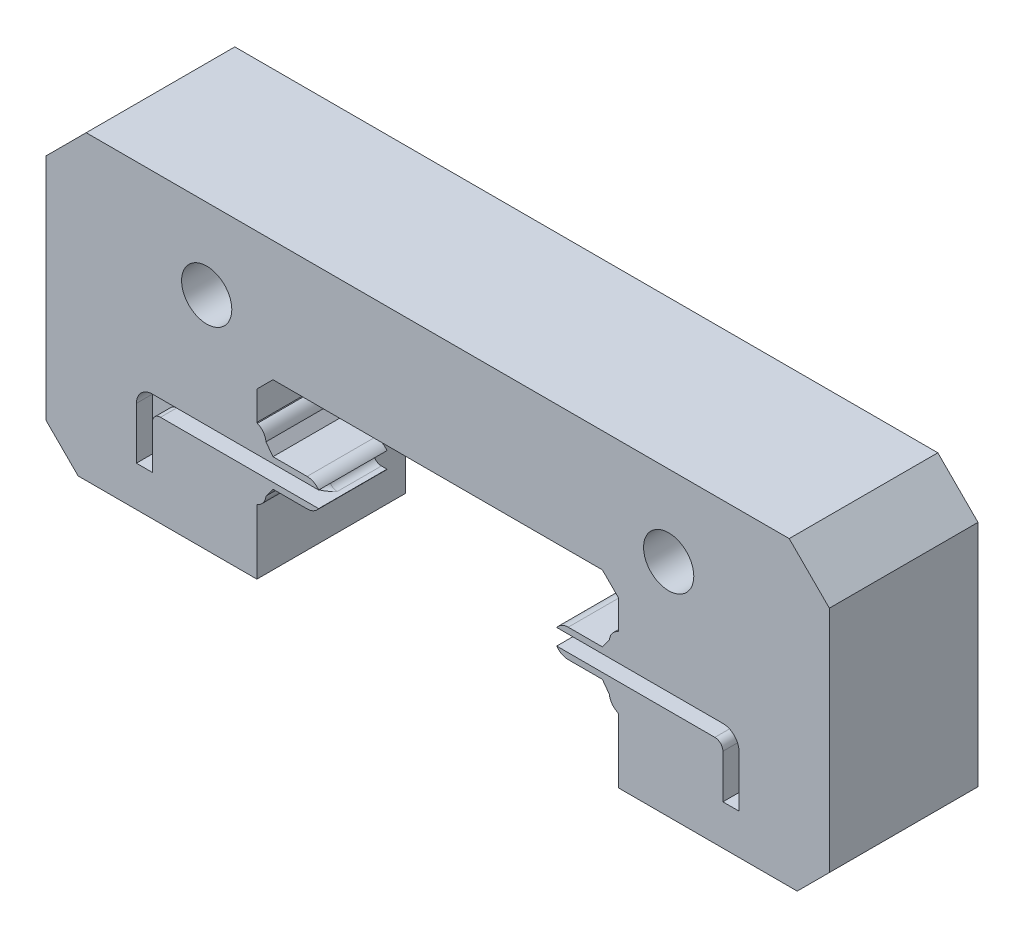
ISO-10303-21;
HEADER;
FILE_DESCRIPTION(('STEP AP214'),'2;1');
FILE_NAME('part.step','',(''),(''),'','','');
FILE_SCHEMA(('AUTOMOTIVE_DESIGN { 1 0 10303 214 1 1 1 1 }'));
ENDSEC;
DATA;
#1=APPLICATION_CONTEXT('core data for automotive mechanical design processes');
#2=APPLICATION_PROTOCOL_DEFINITION('international standard','automotive_design',2000,#1);
#3=PRODUCT_CONTEXT('',#1,'mechanical');
#4=PRODUCT('Part','Part','',(#3));
#5=PRODUCT_RELATED_PRODUCT_CATEGORY('part','',(#4));
#6=PRODUCT_DEFINITION_FORMATION('','',#4);
#7=PRODUCT_DEFINITION_CONTEXT('part definition',#1,'design');
#8=PRODUCT_DEFINITION('design','',#6,#7);
#9=PRODUCT_DEFINITION_SHAPE('','',#8);
#10=(LENGTH_UNIT() NAMED_UNIT(*) SI_UNIT(.MILLI.,.METRE.));
#11=(NAMED_UNIT(*) PLANE_ANGLE_UNIT() SI_UNIT($,.RADIAN.));
#12=(NAMED_UNIT(*) SI_UNIT($,.STERADIAN.) SOLID_ANGLE_UNIT());
#13=UNCERTAINTY_MEASURE_WITH_UNIT(LENGTH_MEASURE(1.E-05),#10,'distance_accuracy_value','');
#14=(GEOMETRIC_REPRESENTATION_CONTEXT(3) GLOBAL_UNCERTAINTY_ASSIGNED_CONTEXT((#13)) GLOBAL_UNIT_ASSIGNED_CONTEXT((#10,
#11,#12)) REPRESENTATION_CONTEXT('',''));
#15=CARTESIAN_POINT('',(0.,0.,0.));
#16=DIRECTION('',(0.,0.,1.));
#17=DIRECTION('',(1.,0.,0.));
#18=AXIS2_PLACEMENT_3D('',#15,#16,#17);
#19=CARTESIAN_POINT('',(3.25,2.49,200.));
#20=DIRECTION('',(0.,0.,-1.));
#21=DIRECTION('',(-1.,0.,0.));
#22=AXIS2_PLACEMENT_3D('',#19,#20,#21);
#23=CYLINDRICAL_SURFACE('',#22,0.35);
#24=CARTESIAN_POINT('',(3.25,2.49,2.));
#25=DIRECTION('',(0.,0.,1.));
#26=DIRECTION('',(1.,0.,0.));
#27=AXIS2_PLACEMENT_3D('',#24,#25,#26);
#28=CIRCLE('',#27,0.35);
#29=CARTESIAN_POINT('',(2.9627718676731,2.69,2.));
#30=VERTEX_POINT('',#29);
#31=CARTESIAN_POINT('',(3.25,2.84,2.));
#32=VERTEX_POINT('',#31);
#33=EDGE_CURVE('E428',#30,#32,#28,.F.);
#34=ORIENTED_EDGE('',*,*,#33,.F.);
#35=DIRECTION('',(0.,0.,-1.));
#36=VECTOR('',#35,1.);
#37=CARTESIAN_POINT('',(2.9627718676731,2.69,200.));
#38=LINE('',#37,#36);
#39=CARTESIAN_POINT('',(2.9627718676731,2.69,3.70000000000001));
#40=VERTEX_POINT('',#39);
#41=EDGE_CURVE('E410',#40,#30,#38,.T.);
#42=ORIENTED_EDGE('',*,*,#41,.F.);
#43=CARTESIAN_POINT('',(3.25,2.49,3.70000000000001));
#44=DIRECTION('',(0.,0.,1.));
#45=DIRECTION('',(1.,0.,0.));
#46=AXIS2_PLACEMENT_3D('',#43,#44,#45);
#47=CIRCLE('',#46,0.35);
#48=CARTESIAN_POINT('',(3.25,2.84,3.70000000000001));
#49=VERTEX_POINT('',#48);
#50=EDGE_CURVE('E694',#49,#40,#47,.T.);
#51=ORIENTED_EDGE('',*,*,#50,.F.);
#52=DIRECTION('',(0.,0.,-1.));
#53=VECTOR('',#52,1.);
#54=CARTESIAN_POINT('',(3.25,2.84,200.));
#55=LINE('',#54,#53);
#56=EDGE_CURVE('E636',#49,#32,#55,.T.);
#57=ORIENTED_EDGE('',*,*,#56,.T.);
#58=EDGE_LOOP('',(#34,#42,#51,#57));
#59=FACE_BOUND('',#58,.T.);
#60=ADVANCED_FACE('F17',(#59),#23,.T.);
#61=CARTESIAN_POINT('',(-3.25,2.49,200.));
#62=DIRECTION('',(0.,0.,-1.));
#63=DIRECTION('',(-1.,0.,0.));
#64=AXIS2_PLACEMENT_3D('',#61,#62,#63);
#65=CYLINDRICAL_SURFACE('',#64,0.35);
#66=CARTESIAN_POINT('',(-3.25,2.49,2.));
#67=DIRECTION('',(0.,0.,-1.));
#68=DIRECTION('',(-1.,0.,0.));
#69=AXIS2_PLACEMENT_3D('',#66,#67,#68);
#70=CIRCLE('',#69,0.35);
#71=CARTESIAN_POINT('',(-3.25,2.14,2.));
#72=VERTEX_POINT('',#71);
#73=CARTESIAN_POINT('',(-2.9627718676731,2.29,2.));
#74=VERTEX_POINT('',#73);
#75=EDGE_CURVE('E465',#72,#74,#70,.F.);
#76=ORIENTED_EDGE('',*,*,#75,.T.);
#77=DIRECTION('',(0.,0.,-1.));
#78=VECTOR('',#77,1.);
#79=CARTESIAN_POINT('',(-2.9627718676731,2.29,200.));
#80=LINE('',#79,#78);
#81=CARTESIAN_POINT('',(-2.9627718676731,2.29,3.70000000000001));
#82=VERTEX_POINT('',#81);
#83=EDGE_CURVE('E826',#82,#74,#80,.T.);
#84=ORIENTED_EDGE('',*,*,#83,.F.);
#85=CARTESIAN_POINT('',(-3.25,2.49,3.70000000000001));
#86=DIRECTION('',(0.,0.,1.));
#87=DIRECTION('',(1.,0.,0.));
#88=AXIS2_PLACEMENT_3D('',#85,#86,#87);
#89=CIRCLE('',#88,0.35);
#90=CARTESIAN_POINT('',(-3.25,2.14,3.70000000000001));
#91=VERTEX_POINT('',#90);
#92=EDGE_CURVE('E721',#91,#82,#89,.T.);
#93=ORIENTED_EDGE('',*,*,#92,.F.);
#94=DIRECTION('',(0.,0.,-1.));
#95=VECTOR('',#94,1.);
#96=CARTESIAN_POINT('',(-3.25,2.14,200.));
#97=LINE('',#96,#95);
#98=EDGE_CURVE('E653',#91,#72,#97,.T.);
#99=ORIENTED_EDGE('',*,*,#98,.T.);
#100=EDGE_LOOP('',(#76,#84,#93,#99));
#101=FACE_BOUND('',#100,.T.);
#102=ADVANCED_FACE('F953',(#101),#65,.T.);
#103=CARTESIAN_POINT('',(-4.5,1.6,200.));
#104=DIRECTION('',(0.803557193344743,-0.59522755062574,0.));
#105=DIRECTION('',(0.595227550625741,0.803557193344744,0.));
#106=AXIS2_PLACEMENT_3D('',#103,#104,#105);
#107=PLANE('',#106);
#108=DIRECTION('',(0.,0.,1.));
#109=VECTOR('',#108,1.);
#110=CARTESIAN_POINT('',(-4.27364831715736,1.90557477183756,0.));
#111=LINE('',#110,#109);
#112=CARTESIAN_POINT('',(-4.27364831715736,1.90557477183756,2.));
#113=VERTEX_POINT('',#112);
#114=CARTESIAN_POINT('',(-4.27364831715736,1.90557477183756,3.7));
#115=VERTEX_POINT('',#114);
#116=EDGE_CURVE('E600',#113,#115,#111,.T.);
#117=ORIENTED_EDGE('',*,*,#116,.F.);
#118=DIRECTION('',(0.595227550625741,0.803557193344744,0.));
#119=VECTOR('',#118,1.);
#120=CARTESIAN_POINT('',(-4.5,1.6,2.));
#121=LINE('',#120,#119);
#122=CARTESIAN_POINT('',(-4.1,2.14,2.));
#123=VERTEX_POINT('',#122);
#124=EDGE_CURVE('E455',#113,#123,#121,.T.);
#125=ORIENTED_EDGE('',*,*,#124,.T.);
#126=DIRECTION('',(0.,0.,-1.));
#127=VECTOR('',#126,1.);
#128=CARTESIAN_POINT('',(-4.1,2.14,200.));
#129=LINE('',#128,#127);
#130=CARTESIAN_POINT('',(-4.1,2.14,3.70000000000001));
#131=VERTEX_POINT('',#130);
#132=EDGE_CURVE('E650',#131,#123,#129,.T.);
#133=ORIENTED_EDGE('',*,*,#132,.F.);
#134=DIRECTION('',(0.595227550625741,0.803557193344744,0.));
#135=VECTOR('',#134,1.);
#136=CARTESIAN_POINT('',(3.37068201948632,12.2254207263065,3.7));
#137=LINE('',#136,#135);
#138=EDGE_CURVE('E739',#115,#131,#137,.T.);
#139=ORIENTED_EDGE('',*,*,#138,.F.);
#140=EDGE_LOOP('',(#117,#125,#133,#139));
#141=FACE_BOUND('',#140,.T.);
#142=ADVANCED_FACE('F942',(#141),#107,.T.);
#143=CARTESIAN_POINT('',(-4.1,2.84,200.));
#144=DIRECTION('',(0.803557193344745,0.595227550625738,0.));
#145=DIRECTION('',(-0.595227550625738,0.803557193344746,0.));
#146=AXIS2_PLACEMENT_3D('',#143,#144,#145);
#147=PLANE('',#146);
#148=DIRECTION('',(0.,0.,1.));
#149=VECTOR('',#148,1.);
#150=CARTESIAN_POINT('',(-4.48826066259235,3.36415189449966,0.));
#151=LINE('',#150,#149);
#152=CARTESIAN_POINT('',(-4.48826066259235,3.36415189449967,2.));
#153=VERTEX_POINT('',#152);
#154=CARTESIAN_POINT('',(-4.48826066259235,3.36415189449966,3.7));
#155=VERTEX_POINT('',#154);
#156=EDGE_CURVE('E605',#153,#155,#151,.T.);
#157=ORIENTED_EDGE('',*,*,#156,.F.);
#158=DIRECTION('',(-0.595227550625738,0.803557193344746,0.));
#159=VECTOR('',#158,1.);
#160=CARTESIAN_POINT('',(-4.1,2.84,2.));
#161=LINE('',#160,#159);
#162=CARTESIAN_POINT('',(-4.5,3.37999999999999,2.));
#163=VERTEX_POINT('',#162);
#164=EDGE_CURVE('E477',#153,#163,#161,.T.);
#165=ORIENTED_EDGE('',*,*,#164,.T.);
#166=DIRECTION('',(0.,0.,-1.));
#167=VECTOR('',#166,1.);
#168=CARTESIAN_POINT('',(-4.5,3.37999999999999,200.));
#169=LINE('',#168,#167);
#170=CARTESIAN_POINT('',(-4.5,3.37999999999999,3.70000000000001));
#171=VERTEX_POINT('',#170);
#172=EDGE_CURVE('E662',#171,#163,#169,.T.);
#173=ORIENTED_EDGE('',*,*,#172,.F.);
#174=DIRECTION('',(-0.595227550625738,0.803557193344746,0.));
#175=VECTOR('',#174,1.);
#176=CARTESIAN_POINT('',(-1.42187776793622,-0.775465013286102,3.7));
#177=LINE('',#176,#175);
#178=EDGE_CURVE('E736',#155,#171,#177,.T.);
#179=ORIENTED_EDGE('',*,*,#178,.F.);
#180=EDGE_LOOP('',(#157,#165,#173,#179));
#181=FACE_BOUND('',#180,.T.);
#182=ADVANCED_FACE('F938',(#181),#147,.T.);
#183=DIRECTION('',(0.,0.,-1.));
#184=VECTOR('',#183,1.);
#185=CARTESIAN_POINT('',(-4.1,2.84,200.));
#186=LINE('',#185,#184);
#187=CARTESIAN_POINT('',(-4.1,2.84,3.70000000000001));
#188=VERTEX_POINT('',#187);
#189=CARTESIAN_POINT('',(-4.1,2.84,2.));
#190=VERTEX_POINT('',#189);
#191=EDGE_CURVE('E659',#188,#190,#186,.T.);
#192=ORIENTED_EDGE('',*,*,#191,.T.);
#193=DIRECTION('',(-0.595227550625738,0.803557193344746,0.));
#194=VECTOR('',#193,1.);
#195=CARTESIAN_POINT('',(-4.1,2.84,2.));
#196=LINE('',#195,#194);
#197=CARTESIAN_POINT('',(-4.27364831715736,3.07442522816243,2.));
#198=VERTEX_POINT('',#197);
#199=EDGE_CURVE('E471',#190,#198,#196,.T.);
#200=ORIENTED_EDGE('',*,*,#199,.T.);
#201=DIRECTION('',(0.,0.,1.));
#202=VECTOR('',#201,1.);
#203=CARTESIAN_POINT('',(-4.27364831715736,3.07442522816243,0.));
#204=LINE('',#203,#202);
#205=CARTESIAN_POINT('',(-4.27364831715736,3.07442522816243,3.7));
#206=VERTEX_POINT('',#205);
#207=EDGE_CURVE('E602',#206,#198,#204,.F.);
#208=ORIENTED_EDGE('',*,*,#207,.F.);
#209=DIRECTION('',(-0.595227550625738,0.803557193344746,0.));
#210=VECTOR('',#209,1.);
#211=CARTESIAN_POINT('',(-1.42187776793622,-0.775465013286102,3.7));
#212=LINE('',#211,#210);
#213=EDGE_CURVE('E727',#188,#206,#212,.T.);
#214=ORIENTED_EDGE('',*,*,#213,.F.);
#215=EDGE_LOOP('',(#192,#200,#208,#214));
#216=FACE_BOUND('',#215,.T.);
#217=ADVANCED_FACE('F941',(#216),#147,.T.);
#218=CARTESIAN_POINT('',(-3.25,2.84,200.));
#219=DIRECTION('',(0.,1.,0.));
#220=DIRECTION('',(-1.,0.,0.));
#221=AXIS2_PLACEMENT_3D('',#218,#219,#220);
#222=PLANE('',#221);
#223=DIRECTION('',(0.,0.,-1.));
#224=VECTOR('',#223,1.);
#225=CARTESIAN_POINT('',(-3.25,2.84,200.));
#226=LINE('',#225,#224);
#227=CARTESIAN_POINT('',(-3.25,2.84,3.70000000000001));
#228=VERTEX_POINT('',#227);
#229=CARTESIAN_POINT('',(-3.25,2.84,2.));
#230=VERTEX_POINT('',#229);
#231=EDGE_CURVE('E656',#228,#230,#226,.T.);
#232=ORIENTED_EDGE('',*,*,#231,.T.);
#233=DIRECTION('',(-1.,0.,0.));
#234=VECTOR('',#233,1.);
#235=CARTESIAN_POINT('',(-3.25,2.84,2.));
#236=LINE('',#235,#234);
#237=EDGE_CURVE('E468',#230,#190,#236,.T.);
#238=ORIENTED_EDGE('',*,*,#237,.T.);
#239=ORIENTED_EDGE('',*,*,#191,.F.);
#240=DIRECTION('',(-1.,0.,0.));
#241=VECTOR('',#240,1.);
#242=CARTESIAN_POINT('',(9.75000000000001,2.84000000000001,3.7));
#243=LINE('',#242,#241);
#244=EDGE_CURVE('E724',#228,#188,#243,.T.);
#245=ORIENTED_EDGE('',*,*,#244,.F.);
#246=EDGE_LOOP('',(#232,#238,#239,#245));
#247=FACE_BOUND('',#246,.T.);
#248=ADVANCED_FACE('F944',(#247),#222,.T.);
#249=DIRECTION('',(0.,0.,-1.));
#250=VECTOR('',#249,1.);
#251=CARTESIAN_POINT('',(-2.9627718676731,2.69,200.));
#252=LINE('',#251,#250);
#253=CARTESIAN_POINT('',(-2.9627718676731,2.69,2.));
#254=VERTEX_POINT('',#253);
#255=CARTESIAN_POINT('',(-2.9627718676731,2.69,3.70000000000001));
#256=VERTEX_POINT('',#255);
#257=EDGE_CURVE('E828',#254,#256,#252,.F.);
#258=ORIENTED_EDGE('',*,*,#257,.F.);
#259=EDGE_CURVE('E464',#254,#230,#70,.F.);
#260=ORIENTED_EDGE('',*,*,#259,.T.);
#261=ORIENTED_EDGE('',*,*,#231,.F.);
#262=EDGE_CURVE('E720',#256,#228,#89,.T.);
#263=ORIENTED_EDGE('',*,*,#262,.F.);
#264=EDGE_LOOP('',(#258,#260,#261,#263));
#265=FACE_BOUND('',#264,.T.);
#266=ADVANCED_FACE('F947',(#265),#65,.T.);
#267=CARTESIAN_POINT('',(-3.25,2.14,200.));
#268=DIRECTION('',(0.,-1.,0.));
#269=DIRECTION('',(1.,0.,0.));
#270=AXIS2_PLACEMENT_3D('',#267,#268,#269);
#271=PLANE('',#270);
#272=ORIENTED_EDGE('',*,*,#132,.T.);
#273=DIRECTION('',(1.,0.,0.));
#274=VECTOR('',#273,1.);
#275=CARTESIAN_POINT('',(-3.25,2.14,2.));
#276=LINE('',#275,#274);
#277=EDGE_CURVE('E461',#123,#72,#276,.T.);
#278=ORIENTED_EDGE('',*,*,#277,.T.);
#279=ORIENTED_EDGE('',*,*,#98,.F.);
#280=DIRECTION('',(1.,0.,0.));
#281=VECTOR('',#280,1.);
#282=CARTESIAN_POINT('',(9.75000000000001,2.14000000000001,3.7));
#283=LINE('',#282,#281);
#284=EDGE_CURVE('E717',#131,#91,#283,.T.);
#285=ORIENTED_EDGE('',*,*,#284,.F.);
#286=EDGE_LOOP('',(#272,#278,#279,#285));
#287=FACE_BOUND('',#286,.T.);
#288=ADVANCED_FACE('F951',(#287),#271,.T.);
#289=DIRECTION('',(0.,0.,-1.));
#290=VECTOR('',#289,1.);
#291=CARTESIAN_POINT('',(-4.5,1.6,200.));
#292=LINE('',#291,#290);
#293=CARTESIAN_POINT('',(-4.5,1.6,3.70000000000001));
#294=VERTEX_POINT('',#293);
#295=CARTESIAN_POINT('',(-4.5,1.6,2.));
#296=VERTEX_POINT('',#295);
#297=EDGE_CURVE('E647',#294,#296,#292,.T.);
#298=ORIENTED_EDGE('',*,*,#297,.T.);
#299=DIRECTION('',(0.595227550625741,0.803557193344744,0.));
#300=VECTOR('',#299,1.);
#301=CARTESIAN_POINT('',(-4.5,1.6,2.));
#302=LINE('',#301,#300);
#303=CARTESIAN_POINT('',(-4.48826066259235,1.61584810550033,2.));
#304=VERTEX_POINT('',#303);
#305=EDGE_CURVE('E450',#296,#304,#302,.T.);
#306=ORIENTED_EDGE('',*,*,#305,.T.);
#307=DIRECTION('',(0.,0.,1.));
#308=VECTOR('',#307,1.);
#309=CARTESIAN_POINT('',(-4.48826066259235,1.61584810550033,0.));
#310=LINE('',#309,#308);
#311=CARTESIAN_POINT('',(-4.48826066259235,1.61584810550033,3.7));
#312=VERTEX_POINT('',#311);
#313=EDGE_CURVE('E597',#312,#304,#310,.F.);
#314=ORIENTED_EDGE('',*,*,#313,.F.);
#315=DIRECTION('',(0.595227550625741,0.803557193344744,0.));
#316=VECTOR('',#315,1.);
#317=CARTESIAN_POINT('',(3.37068201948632,12.2254207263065,3.7));
#318=LINE('',#317,#316);
#319=EDGE_CURVE('E714',#294,#312,#318,.T.);
#320=ORIENTED_EDGE('',*,*,#319,.F.);
#321=EDGE_LOOP('',(#298,#306,#314,#320));
#322=FACE_BOUND('',#321,.T.);
#323=ADVANCED_FACE('F956',(#322),#107,.T.);
#324=CARTESIAN_POINT('',(-4.62202164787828,3.04072029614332,0.));
#325=DIRECTION('',(0.,0.,1.));
#326=DIRECTION('',(1.,0.,0.));
#327=AXIS2_PLACEMENT_3D('',#324,#325,#326);
#328=CYLINDRICAL_SURFACE('',#327,0.35);
#329=ORIENTED_EDGE('',*,*,#207,.T.);
#330=CARTESIAN_POINT('',(-4.62202164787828,3.04072029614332,2.));
#331=DIRECTION('',(0.,0.,-1.));
#332=DIRECTION('',(-1.,0.,0.));
#333=AXIS2_PLACEMENT_3D('',#330,#331,#332);
#334=CIRCLE('',#333,0.35);
#335=EDGE_CURVE('E474',#198,#153,#334,.F.);
#336=ORIENTED_EDGE('',*,*,#335,.T.);
#337=ORIENTED_EDGE('',*,*,#156,.T.);
#338=CARTESIAN_POINT('',(-4.62202164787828,3.04072029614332,3.7));
#339=DIRECTION('',(0.,0.,1.));
#340=DIRECTION('',(1.,0.,0.));
#341=AXIS2_PLACEMENT_3D('',#338,#339,#340);
#342=CIRCLE('',#341,0.35);
#343=EDGE_CURVE('E676',#206,#155,#342,.T.);
#344=ORIENTED_EDGE('',*,*,#343,.F.);
#345=EDGE_LOOP('',(#329,#336,#337,#344));
#346=FACE_BOUND('',#345,.T.);
#347=ADVANCED_FACE('F999',(#346),#328,.T.);
#348=CARTESIAN_POINT('',(-4.62202164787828,1.93927970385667,0.));
#349=DIRECTION('',(0.,0.,1.));
#350=DIRECTION('',(1.,0.,0.));
#351=AXIS2_PLACEMENT_3D('',#348,#349,#350);
#352=CYLINDRICAL_SURFACE('',#351,0.35);
#353=ORIENTED_EDGE('',*,*,#313,.T.);
#354=CARTESIAN_POINT('',(-4.62202164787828,1.93927970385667,2.));
#355=DIRECTION('',(0.,0.,-1.));
#356=DIRECTION('',(-1.,0.,0.));
#357=AXIS2_PLACEMENT_3D('',#354,#355,#356);
#358=CIRCLE('',#357,0.35);
#359=EDGE_CURVE('E409',#304,#113,#358,.F.);
#360=ORIENTED_EDGE('',*,*,#359,.T.);
#361=ORIENTED_EDGE('',*,*,#116,.T.);
#362=CARTESIAN_POINT('',(-4.62202164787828,1.93927970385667,3.7));
#363=DIRECTION('',(0.,0.,1.));
#364=DIRECTION('',(1.,0.,0.));
#365=AXIS2_PLACEMENT_3D('',#362,#363,#364);
#366=CIRCLE('',#365,0.35);
#367=EDGE_CURVE('E673',#312,#115,#366,.T.);
#368=ORIENTED_EDGE('',*,*,#367,.F.);
#369=EDGE_LOOP('',(#353,#360,#361,#368));
#370=FACE_BOUND('',#369,.T.);
#371=ADVANCED_FACE('F911',(#370),#352,.T.);
#372=CARTESIAN_POINT('',(9.75,0.,3.7));
#373=DIRECTION('',(0.,1.,0.));
#374=DIRECTION('',(0.,0.,1.));
#375=AXIS2_PLACEMENT_3D('',#372,#373,#374);
#376=PLANE('',#375);
#377=DIRECTION('',(0.,0.,-1.));
#378=VECTOR('',#377,1.);
#379=CARTESIAN_POINT('',(-4.5,0.,3.7));
#380=LINE('',#379,#378);
#381=CARTESIAN_POINT('',(-4.5,0.,3.7));
#382=VERTEX_POINT('',#381);
#383=CARTESIAN_POINT('',(-4.5,0.,0.));
#384=VERTEX_POINT('',#383);
#385=EDGE_CURVE('E711',#382,#384,#380,.T.);
#386=ORIENTED_EDGE('',*,*,#385,.F.);
#387=DIRECTION('',(1.,0.,0.));
#388=VECTOR('',#387,1.);
#389=CARTESIAN_POINT('',(9.75,0.,3.7));
#390=LINE('',#389,#388);
#391=CARTESIAN_POINT('',(-8.95,0.,3.7));
#392=VERTEX_POINT('',#391);
#393=EDGE_CURVE('E771',#392,#382,#390,.T.);
#394=ORIENTED_EDGE('',*,*,#393,.F.);
#395=DIRECTION('',(0.,0.,-1.));
#396=VECTOR('',#395,1.);
#397=CARTESIAN_POINT('',(-8.95,0.,3.7));
#398=LINE('',#397,#396);
#399=CARTESIAN_POINT('',(-8.95,0.,0.));
#400=VERTEX_POINT('',#399);
#401=EDGE_CURVE('E812',#392,#400,#398,.T.);
#402=ORIENTED_EDGE('',*,*,#401,.T.);
#403=DIRECTION('',(1.,0.,0.));
#404=VECTOR('',#403,1.);
#405=CARTESIAN_POINT('',(9.75,0.,0.));
#406=LINE('',#405,#404);
#407=EDGE_CURVE('E764',#400,#384,#406,.T.);
#408=ORIENTED_EDGE('',*,*,#407,.T.);
#409=EDGE_LOOP('',(#386,#394,#402,#408));
#410=FACE_BOUND('',#409,.T.);
#411=ADVANCED_FACE('F907',(#410),#376,.F.);
#412=DIRECTION('',(0.,0.,1.));
#413=VECTOR('',#412,1.);
#414=CARTESIAN_POINT('',(4.5,0.,3.7));
#415=LINE('',#414,#413);
#416=CARTESIAN_POINT('',(4.5,0.,0.));
#417=VERTEX_POINT('',#416);
#418=CARTESIAN_POINT('',(4.5,0.,3.7));
#419=VERTEX_POINT('',#418);
#420=EDGE_CURVE('E706',#417,#419,#415,.T.);
#421=ORIENTED_EDGE('',*,*,#420,.F.);
#422=CARTESIAN_POINT('',(8.95,0.,0.));
#423=VERTEX_POINT('',#422);
#424=EDGE_CURVE('E782',#417,#423,#406,.T.);
#425=ORIENTED_EDGE('',*,*,#424,.T.);
#426=DIRECTION('',(0.,0.,1.));
#427=VECTOR('',#426,1.);
#428=CARTESIAN_POINT('',(8.95,0.,3.7));
#429=LINE('',#428,#427);
#430=CARTESIAN_POINT('',(8.95,0.,3.7));
#431=VERTEX_POINT('',#430);
#432=EDGE_CURVE('E815',#423,#431,#429,.T.);
#433=ORIENTED_EDGE('',*,*,#432,.T.);
#434=EDGE_CURVE('E770',#419,#431,#390,.T.);
#435=ORIENTED_EDGE('',*,*,#434,.F.);
#436=EDGE_LOOP('',(#421,#425,#433,#435));
#437=FACE_BOUND('',#436,.T.);
#438=ADVANCED_FACE('F910',(#437),#376,.F.);
#439=CARTESIAN_POINT('',(9.75,7.5,3.7));
#440=DIRECTION('',(0.,0.,1.));
#441=DIRECTION('',(1.,0.,0.));
#442=AXIS2_PLACEMENT_3D('',#439,#440,#441);
#443=PLANE('',#442);
#444=DIRECTION('',(1.,0.,0.));
#445=VECTOR('',#444,1.);
#446=CARTESIAN_POINT('',(6.9,2.29,3.7));
#447=LINE('',#446,#445);
#448=CARTESIAN_POINT('',(2.9627718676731,2.29,3.70000000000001));
#449=VERTEX_POINT('',#448);
#450=CARTESIAN_POINT('',(6.9,2.29,3.7));
#451=VERTEX_POINT('',#450);
#452=EDGE_CURVE('E510',#449,#451,#447,.T.);
#453=ORIENTED_EDGE('',*,*,#452,.F.);
#454=CARTESIAN_POINT('',(3.25,2.14,3.70000000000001));
#455=VERTEX_POINT('',#454);
#456=EDGE_CURVE('E406',#449,#455,#47,.T.);
#457=ORIENTED_EDGE('',*,*,#456,.T.);
#458=DIRECTION('',(1.,0.,0.));
#459=VECTOR('',#458,1.);
#460=CARTESIAN_POINT('',(9.74999999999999,2.13999999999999,3.7));
#461=LINE('',#460,#459);
#462=CARTESIAN_POINT('',(4.1,2.14,3.70000000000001));
#463=VERTEX_POINT('',#462);
#464=EDGE_CURVE('E697',#455,#463,#461,.T.);
#465=ORIENTED_EDGE('',*,*,#464,.T.);
#466=DIRECTION('',(0.595227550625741,-0.803557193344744,0.));
#467=VECTOR('',#466,1.);
#468=CARTESIAN_POINT('',(3.53808680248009,2.89858281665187,3.7));
#469=LINE('',#468,#467);
#470=CARTESIAN_POINT('',(4.27364831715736,1.90557477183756,3.7));
#471=VERTEX_POINT('',#470);
#472=EDGE_CURVE('E700',#463,#471,#469,.T.);
#473=ORIENTED_EDGE('',*,*,#472,.T.);
#474=CARTESIAN_POINT('',(4.62202164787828,1.93927970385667,3.7));
#475=DIRECTION('',(0.,0.,1.));
#476=DIRECTION('',(1.,0.,0.));
#477=AXIS2_PLACEMENT_3D('',#474,#475,#476);
#478=CIRCLE('',#477,0.35);
#479=CARTESIAN_POINT('',(4.48826066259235,1.61584810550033,3.7));
#480=VERTEX_POINT('',#479);
#481=EDGE_CURVE('E667',#471,#480,#478,.T.);
#482=ORIENTED_EDGE('',*,*,#481,.T.);
#483=DIRECTION('',(0.595227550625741,-0.803557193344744,0.));
#484=VECTOR('',#483,1.);
#485=CARTESIAN_POINT('',(3.53808680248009,2.89858281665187,3.7));
#486=LINE('',#485,#484);
#487=CARTESIAN_POINT('',(4.5,1.6,3.70000000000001));
#488=VERTEX_POINT('',#487);
#489=EDGE_CURVE('E745',#480,#488,#486,.T.);
#490=ORIENTED_EDGE('',*,*,#489,.T.);
#491=DIRECTION('',(0.,-1.,0.));
#492=VECTOR('',#491,1.);
#493=CARTESIAN_POINT('',(4.5,7.49999999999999,3.7));
#494=LINE('',#493,#492);
#495=EDGE_CURVE('E703',#488,#419,#494,.T.);
#496=ORIENTED_EDGE('',*,*,#495,.T.);
#497=ORIENTED_EDGE('',*,*,#434,.T.);
#498=DIRECTION('',(-0.707106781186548,-0.707106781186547,0.));
#499=VECTOR('',#498,1.);
#500=CARTESIAN_POINT('',(13.1,4.14999999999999,3.7));
#501=LINE('',#500,#499);
#502=CARTESIAN_POINT('',(9.75,0.799999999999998,3.7));
#503=VERTEX_POINT('',#502);
#504=EDGE_CURVE('E820',#431,#503,#501,.F.);
#505=ORIENTED_EDGE('',*,*,#504,.T.);
#506=DIRECTION('',(0.,1.,0.));
#507=VECTOR('',#506,1.);
#508=CARTESIAN_POINT('',(9.75,0.,3.7));
#509=LINE('',#508,#507);
#510=CARTESIAN_POINT('',(9.75,6.5,3.7));
#511=VERTEX_POINT('',#510);
#512=EDGE_CURVE('E761',#503,#511,#509,.T.);
#513=ORIENTED_EDGE('',*,*,#512,.T.);
#514=DIRECTION('',(0.707106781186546,-0.707106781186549,0.));
#515=VECTOR('',#514,1.);
#516=CARTESIAN_POINT('',(9.25,7.,3.7));
#517=LINE('',#516,#515);
#518=CARTESIAN_POINT('',(8.75,7.5,3.7));
#519=VERTEX_POINT('',#518);
#520=EDGE_CURVE('E799',#511,#519,#517,.F.);
#521=ORIENTED_EDGE('',*,*,#520,.T.);
#522=DIRECTION('',(-1.,0.,0.));
#523=VECTOR('',#522,1.);
#524=CARTESIAN_POINT('',(9.75,7.5,3.7));
#525=LINE('',#524,#523);
#526=CARTESIAN_POINT('',(-8.74999999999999,7.5,3.7));
#527=VERTEX_POINT('',#526);
#528=EDGE_CURVE('E763',#519,#527,#525,.T.);
#529=ORIENTED_EDGE('',*,*,#528,.T.);
#530=DIRECTION('',(0.70710678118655,0.707106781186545,0.));
#531=VECTOR('',#530,1.);
#532=CARTESIAN_POINT('',(0.500000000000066,16.75,3.7));
#533=LINE('',#532,#531);
#534=CARTESIAN_POINT('',(-9.75,6.5,3.7));
#535=VERTEX_POINT('',#534);
#536=EDGE_CURVE('E797',#527,#535,#533,.F.);
#537=ORIENTED_EDGE('',*,*,#536,.T.);
#538=DIRECTION('',(0.,-1.,0.));
#539=VECTOR('',#538,1.);
#540=CARTESIAN_POINT('',(-9.75,0.,3.7));
#541=LINE('',#540,#539);
#542=CARTESIAN_POINT('',(-9.75,0.800000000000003,3.7));
#543=VERTEX_POINT('',#542);
#544=EDGE_CURVE('E767',#535,#543,#541,.T.);
#545=ORIENTED_EDGE('',*,*,#544,.T.);
#546=DIRECTION('',(-0.707106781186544,0.707106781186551,0.));
#547=VECTOR('',#546,1.);
#548=CARTESIAN_POINT('',(-3.35000000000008,-5.59999999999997,3.7));
#549=LINE('',#548,#547);
#550=EDGE_CURVE('E818',#543,#392,#549,.F.);
#551=ORIENTED_EDGE('',*,*,#550,.T.);
#552=ORIENTED_EDGE('',*,*,#393,.T.);
#553=DIRECTION('',(0.,1.,0.));
#554=VECTOR('',#553,1.);
#555=CARTESIAN_POINT('',(-4.5,7.5,3.7));
#556=LINE('',#555,#554);
#557=EDGE_CURVE('E708',#382,#294,#556,.T.);
#558=ORIENTED_EDGE('',*,*,#557,.T.);
#559=ORIENTED_EDGE('',*,*,#319,.T.);
#560=ORIENTED_EDGE('',*,*,#367,.T.);
#561=ORIENTED_EDGE('',*,*,#138,.T.);
#562=ORIENTED_EDGE('',*,*,#284,.T.);
#563=ORIENTED_EDGE('',*,*,#92,.T.);
#564=DIRECTION('',(1.,0.,0.));
#565=VECTOR('',#564,1.);
#566=CARTESIAN_POINT('',(-6.9,2.29,3.7));
#567=LINE('',#566,#565);
#568=CARTESIAN_POINT('',(-6.9,2.29,3.7));
#569=VERTEX_POINT('',#568);
#570=EDGE_CURVE('E566',#569,#82,#567,.T.);
#571=ORIENTED_EDGE('',*,*,#570,.F.);
#572=CARTESIAN_POINT('',(-6.9,2.09,3.7));
#573=DIRECTION('',(0.,0.,-1.));
#574=DIRECTION('',(-1.,0.,0.));
#575=AXIS2_PLACEMENT_3D('',#572,#573,#574);
#576=CIRCLE('',#575,0.2);
#577=CARTESIAN_POINT('',(-7.1,2.08999999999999,3.7));
#578=VERTEX_POINT('',#577);
#579=EDGE_CURVE('E563',#578,#569,#576,.T.);
#580=ORIENTED_EDGE('',*,*,#579,.F.);
#581=DIRECTION('',(0.,1.,0.));
#582=VECTOR('',#581,1.);
#583=CARTESIAN_POINT('',(-7.1,0.999999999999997,3.7));
#584=LINE('',#583,#582);
#585=CARTESIAN_POINT('',(-7.1,0.999999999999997,3.7));
#586=VERTEX_POINT('',#585);
#587=EDGE_CURVE('E560',#586,#578,#584,.T.);
#588=ORIENTED_EDGE('',*,*,#587,.F.);
#589=DIRECTION('',(1.,0.,0.));
#590=VECTOR('',#589,1.);
#591=CARTESIAN_POINT('',(-7.5,0.999999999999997,3.7));
#592=LINE('',#591,#590);
#593=CARTESIAN_POINT('',(-7.5,0.999999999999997,3.7));
#594=VERTEX_POINT('',#593);
#595=EDGE_CURVE('E525',#594,#586,#592,.T.);
#596=ORIENTED_EDGE('',*,*,#595,.F.);
#597=DIRECTION('',(0.,-1.,0.));
#598=VECTOR('',#597,1.);
#599=CARTESIAN_POINT('',(-7.5,0.999999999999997,3.7));
#600=LINE('',#599,#598);
#601=CARTESIAN_POINT('',(-7.5,2.28999999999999,3.7));
#602=VERTEX_POINT('',#601);
#603=EDGE_CURVE('E540',#602,#594,#600,.T.);
#604=ORIENTED_EDGE('',*,*,#603,.F.);
#605=CARTESIAN_POINT('',(-7.1,2.29,3.7));
#606=DIRECTION('',(0.,0.,1.));
#607=DIRECTION('',(1.,0.,0.));
#608=AXIS2_PLACEMENT_3D('',#605,#606,#607);
#609=CIRCLE('',#608,0.4);
#610=CARTESIAN_POINT('',(-7.1,2.69,3.7));
#611=VERTEX_POINT('',#610);
#612=EDGE_CURVE('E570',#611,#602,#609,.T.);
#613=ORIENTED_EDGE('',*,*,#612,.F.);
#614=DIRECTION('',(-1.,0.,0.));
#615=VECTOR('',#614,1.);
#616=CARTESIAN_POINT('',(-7.1,2.69,3.7));
#617=LINE('',#616,#615);
#618=EDGE_CURVE('E568',#256,#611,#617,.T.);
#619=ORIENTED_EDGE('',*,*,#618,.F.);
#620=ORIENTED_EDGE('',*,*,#262,.T.);
#621=ORIENTED_EDGE('',*,*,#244,.T.);
#622=ORIENTED_EDGE('',*,*,#213,.T.);
#623=ORIENTED_EDGE('',*,*,#343,.T.);
#624=ORIENTED_EDGE('',*,*,#178,.T.);
#625=DIRECTION('',(0.,1.,0.));
#626=VECTOR('',#625,1.);
#627=CARTESIAN_POINT('',(-4.5,7.49999999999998,3.7));
#628=LINE('',#627,#626);
#629=CARTESIAN_POINT('',(-4.5,4.09999999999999,3.70000000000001));
#630=VERTEX_POINT('',#629);
#631=EDGE_CURVE('E730',#171,#630,#628,.T.);
#632=ORIENTED_EDGE('',*,*,#631,.T.);
#633=DIRECTION('',(0.707106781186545,0.70710678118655,0.));
#634=VECTOR('',#633,1.);
#635=CARTESIAN_POINT('',(4.32499999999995,12.925,3.7));
#636=LINE('',#635,#634);
#637=CARTESIAN_POINT('',(-4.1,4.5,3.70000000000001));
#638=VERTEX_POINT('',#637);
#639=EDGE_CURVE('E733',#630,#638,#636,.T.);
#640=ORIENTED_EDGE('',*,*,#639,.T.);
#641=DIRECTION('',(1.,0.,0.));
#642=VECTOR('',#641,1.);
#643=CARTESIAN_POINT('',(9.75,4.5,3.7));
#644=LINE('',#643,#642);
#645=CARTESIAN_POINT('',(4.1,4.5,3.70000000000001));
#646=VERTEX_POINT('',#645);
#647=EDGE_CURVE('E679',#638,#646,#644,.T.);
#648=ORIENTED_EDGE('',*,*,#647,.T.);
#649=DIRECTION('',(0.707106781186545,-0.70710678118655,0.));
#650=VECTOR('',#649,1.);
#651=CARTESIAN_POINT('',(5.42499999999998,3.17500000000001,3.7));
#652=LINE('',#651,#650);
#653=CARTESIAN_POINT('',(4.5,4.1,3.70000000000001));
#654=VERTEX_POINT('',#653);
#655=EDGE_CURVE('E682',#646,#654,#652,.T.);
#656=ORIENTED_EDGE('',*,*,#655,.T.);
#657=DIRECTION('',(0.,-1.,0.));
#658=VECTOR('',#657,1.);
#659=CARTESIAN_POINT('',(4.49999999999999,7.49999999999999,3.7));
#660=LINE('',#659,#658);
#661=CARTESIAN_POINT('',(4.5,3.38,3.70000000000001));
#662=VERTEX_POINT('',#661);
#663=EDGE_CURVE('E685',#654,#662,#660,.T.);
#664=ORIENTED_EDGE('',*,*,#663,.T.);
#665=DIRECTION('',(-0.595227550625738,-0.803557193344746,0.));
#666=VECTOR('',#665,1.);
#667=CARTESIAN_POINT('',(8.33064658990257,8.55137289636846,3.7));
#668=LINE('',#667,#666);
#669=CARTESIAN_POINT('',(4.48826066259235,3.36415189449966,3.7));
#670=VERTEX_POINT('',#669);
#671=EDGE_CURVE('E688',#662,#670,#668,.T.);
#672=ORIENTED_EDGE('',*,*,#671,.T.);
#673=CARTESIAN_POINT('',(4.62202164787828,3.04072029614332,3.7));
#674=DIRECTION('',(0.,0.,1.));
#675=DIRECTION('',(1.,0.,0.));
#676=AXIS2_PLACEMENT_3D('',#673,#674,#675);
#677=CIRCLE('',#676,0.35);
#678=CARTESIAN_POINT('',(4.27364831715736,3.07442522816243,3.7));
#679=VERTEX_POINT('',#678);
#680=EDGE_CURVE('E670',#670,#679,#677,.T.);
#681=ORIENTED_EDGE('',*,*,#680,.T.);
#682=DIRECTION('',(-0.595227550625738,-0.803557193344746,0.));
#683=VECTOR('',#682,1.);
#684=CARTESIAN_POINT('',(8.33064658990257,8.55137289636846,3.7));
#685=LINE('',#684,#683);
#686=CARTESIAN_POINT('',(4.1,2.84,3.70000000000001));
#687=VERTEX_POINT('',#686);
#688=EDGE_CURVE('E742',#679,#687,#685,.T.);
#689=ORIENTED_EDGE('',*,*,#688,.T.);
#690=DIRECTION('',(-1.,0.,0.));
#691=VECTOR('',#690,1.);
#692=CARTESIAN_POINT('',(9.74999999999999,2.83999999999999,3.7));
#693=LINE('',#692,#691);
#694=EDGE_CURVE('E691',#687,#49,#693,.T.);
#695=ORIENTED_EDGE('',*,*,#694,.T.);
#696=ORIENTED_EDGE('',*,*,#50,.T.);
#697=DIRECTION('',(-1.,0.,0.));
#698=VECTOR('',#697,1.);
#699=CARTESIAN_POINT('',(7.1,2.69,3.7));
#700=LINE('',#699,#698);
#701=CARTESIAN_POINT('',(7.1,2.69,3.7));
#702=VERTEX_POINT('',#701);
#703=EDGE_CURVE('E508',#702,#40,#700,.T.);
#704=ORIENTED_EDGE('',*,*,#703,.F.);
#705=CARTESIAN_POINT('',(7.1,2.29,3.7));
#706=DIRECTION('',(0.,0.,1.));
#707=DIRECTION('',(-1.,0.,0.));
#708=AXIS2_PLACEMENT_3D('',#705,#706,#707);
#709=CIRCLE('',#708,0.4);
#710=CARTESIAN_POINT('',(7.5,2.28999999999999,3.7));
#711=VERTEX_POINT('',#710);
#712=EDGE_CURVE('E483',#711,#702,#709,.T.);
#713=ORIENTED_EDGE('',*,*,#712,.F.);
#714=DIRECTION('',(0.,1.,0.));
#715=VECTOR('',#714,1.);
#716=CARTESIAN_POINT('',(7.5,0.999999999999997,3.7));
#717=LINE('',#716,#715);
#718=CARTESIAN_POINT('',(7.5,0.999999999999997,3.7));
#719=VERTEX_POINT('',#718);
#720=EDGE_CURVE('E488',#719,#711,#717,.T.);
#721=ORIENTED_EDGE('',*,*,#720,.F.);
#722=DIRECTION('',(1.,0.,0.));
#723=VECTOR('',#722,1.);
#724=CARTESIAN_POINT('',(7.5,0.999999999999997,3.7));
#725=LINE('',#724,#723);
#726=CARTESIAN_POINT('',(7.1,0.999999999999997,3.7));
#727=VERTEX_POINT('',#726);
#728=EDGE_CURVE('E518',#727,#719,#725,.T.);
#729=ORIENTED_EDGE('',*,*,#728,.F.);
#730=DIRECTION('',(0.,-1.,0.));
#731=VECTOR('',#730,1.);
#732=CARTESIAN_POINT('',(7.1,0.999999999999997,3.7));
#733=LINE('',#732,#731);
#734=CARTESIAN_POINT('',(7.1,2.08999999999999,3.7));
#735=VERTEX_POINT('',#734);
#736=EDGE_CURVE('E515',#735,#727,#733,.T.);
#737=ORIENTED_EDGE('',*,*,#736,.F.);
#738=CARTESIAN_POINT('',(6.9,2.09,3.7));
#739=DIRECTION('',(0.,0.,-1.));
#740=DIRECTION('',(1.,0.,0.));
#741=AXIS2_PLACEMENT_3D('',#738,#739,#740);
#742=CIRCLE('',#741,0.2);
#743=EDGE_CURVE('E512',#451,#735,#742,.T.);
#744=ORIENTED_EDGE('',*,*,#743,.F.);
#745=EDGE_LOOP('',(#453,#457,#465,#473,#482,#490,#496,#497,#505,#513,#521,#529,#537,#545,#551,
#552,#558,#559,#560,#561,#562,#563,#571,#580,#588,#596,#604,#613,#619,#620,#621,#622,#623,#624,
#632,#640,#648,#656,#664,#672,#681,#689,#695,#696,#704,#713,#721,#729,#737,#744));
#746=FACE_BOUND('',#745,.T.);
#747=CARTESIAN_POINT('',(5.75,5.5,3.7));
#748=DIRECTION('',(0.,0.,1.));
#749=DIRECTION('',(1.,0.,0.));
#750=AXIS2_PLACEMENT_3D('',#747,#748,#749);
#751=CIRCLE('',#750,0.624999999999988);
#752=CARTESIAN_POINT('',(6.37499999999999,5.5,3.7));
#753=VERTEX_POINT('',#752);
#754=EDGE_CURVE('E754',#753,#753,#751,.T.);
#755=ORIENTED_EDGE('',*,*,#754,.F.);
#756=EDGE_LOOP('',(#755));
#757=FACE_BOUND('',#756,.T.);
#758=CARTESIAN_POINT('',(-5.75,5.5,3.7));
#759=DIRECTION('',(0.,0.,1.));
#760=DIRECTION('',(1.,0.,0.));
#761=AXIS2_PLACEMENT_3D('',#758,#759,#760);
#762=CIRCLE('',#761,0.624999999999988);
#763=CARTESIAN_POINT('',(-5.12500000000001,5.5,3.7));
#764=VERTEX_POINT('',#763);
#765=EDGE_CURVE('E748',#764,#764,#762,.T.);
#766=ORIENTED_EDGE('',*,*,#765,.F.);
#767=EDGE_LOOP('',(#766));
#768=FACE_BOUND('',#767,.T.);
#769=ADVANCED_FACE('F915',(#746,#757,#768),#443,.T.);
#770=CARTESIAN_POINT('',(9.75,7.5,0.));
#771=DIRECTION('',(0.,0.,1.));
#772=DIRECTION('',(1.,0.,0.));
#773=AXIS2_PLACEMENT_3D('',#770,#771,#772);
#774=PLANE('',#773);
#775=CARTESIAN_POINT('',(5.75,5.5,0.));
#776=DIRECTION('',(0.,0.,1.));
#777=DIRECTION('',(1.,0.,0.));
#778=AXIS2_PLACEMENT_3D('',#775,#776,#777);
#779=CIRCLE('',#778,0.624999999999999);
#780=CARTESIAN_POINT('',(6.375,5.5,0.));
#781=VERTEX_POINT('',#780);
#782=EDGE_CURVE('E757',#781,#781,#779,.T.);
#783=ORIENTED_EDGE('',*,*,#782,.T.);
#784=EDGE_LOOP('',(#783));
#785=FACE_BOUND('',#784,.T.);
#786=CARTESIAN_POINT('',(-5.75,5.5,0.));
#787=DIRECTION('',(0.,0.,1.));
#788=DIRECTION('',(1.,0.,0.));
#789=AXIS2_PLACEMENT_3D('',#786,#787,#788);
#790=CIRCLE('',#789,0.624999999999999);
#791=CARTESIAN_POINT('',(-5.125,5.5,0.));
#792=VERTEX_POINT('',#791);
#793=EDGE_CURVE('E751',#792,#792,#790,.T.);
#794=ORIENTED_EDGE('',*,*,#793,.T.);
#795=EDGE_LOOP('',(#794));
#796=FACE_BOUND('',#795,.T.);
#797=DIRECTION('',(0.,-1.,0.));
#798=VECTOR('',#797,1.);
#799=CARTESIAN_POINT('',(4.5,7.49999999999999,0.));
#800=LINE('',#799,#798);
#801=CARTESIAN_POINT('',(4.5,1.49,0.));
#802=VERTEX_POINT('',#801);
#803=EDGE_CURVE('E824',#802,#417,#800,.T.);
#804=ORIENTED_EDGE('',*,*,#803,.F.);
#805=CARTESIAN_POINT('',(4.5,2.49,0.));
#806=DIRECTION('',(0.,0.,-1.));
#807=DIRECTION('',(1.,0.,0.));
#808=AXIS2_PLACEMENT_3D('',#805,#806,#807);
#809=CIRCLE('',#808,0.999999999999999);
#810=CARTESIAN_POINT('',(4.5,3.48999999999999,0.));
#811=VERTEX_POINT('',#810);
#812=EDGE_CURVE('E1061',#811,#802,#809,.T.);
#813=ORIENTED_EDGE('',*,*,#812,.F.);
#814=DIRECTION('',(0.,1.,0.));
#815=VECTOR('',#814,1.);
#816=CARTESIAN_POINT('',(4.5,3.38,0.));
#817=LINE('',#816,#815);
#818=CARTESIAN_POINT('',(4.5,4.1,0.));
#819=VERTEX_POINT('',#818);
#820=EDGE_CURVE('E615',#811,#819,#817,.T.);
#821=ORIENTED_EDGE('',*,*,#820,.T.);
#822=DIRECTION('',(-0.707106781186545,0.70710678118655,0.));
#823=VECTOR('',#822,1.);
#824=CARTESIAN_POINT('',(4.5,4.1,0.));
#825=LINE('',#824,#823);
#826=CARTESIAN_POINT('',(4.1,4.5,0.));
#827=VERTEX_POINT('',#826);
#828=EDGE_CURVE('E617',#819,#827,#825,.T.);
#829=ORIENTED_EDGE('',*,*,#828,.T.);
#830=DIRECTION('',(-1.,0.,0.));
#831=VECTOR('',#830,1.);
#832=CARTESIAN_POINT('',(-4.1,4.5,0.));
#833=LINE('',#832,#831);
#834=CARTESIAN_POINT('',(-4.1,4.5,0.));
#835=VERTEX_POINT('',#834);
#836=EDGE_CURVE('E620',#827,#835,#833,.T.);
#837=ORIENTED_EDGE('',*,*,#836,.T.);
#838=DIRECTION('',(-0.707106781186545,-0.70710678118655,0.));
#839=VECTOR('',#838,1.);
#840=CARTESIAN_POINT('',(-4.5,4.09999999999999,0.));
#841=LINE('',#840,#839);
#842=CARTESIAN_POINT('',(-4.5,4.09999999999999,0.));
#843=VERTEX_POINT('',#842);
#844=EDGE_CURVE('E607',#835,#843,#841,.T.);
#845=ORIENTED_EDGE('',*,*,#844,.T.);
#846=DIRECTION('',(0.,-1.,0.));
#847=VECTOR('',#846,1.);
#848=CARTESIAN_POINT('',(-4.5,3.37999999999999,0.));
#849=LINE('',#848,#847);
#850=CARTESIAN_POINT('',(-4.5,3.48999999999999,0.));
#851=VERTEX_POINT('',#850);
#852=EDGE_CURVE('E610',#843,#851,#849,.T.);
#853=ORIENTED_EDGE('',*,*,#852,.T.);
#854=CARTESIAN_POINT('',(-4.5,2.49,0.));
#855=DIRECTION('',(0.,0.,-1.));
#856=DIRECTION('',(-1.,0.,0.));
#857=AXIS2_PLACEMENT_3D('',#854,#855,#856);
#858=CIRCLE('',#857,0.999999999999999);
#859=CARTESIAN_POINT('',(-4.5,1.49,0.));
#860=VERTEX_POINT('',#859);
#861=EDGE_CURVE('E442',#860,#851,#858,.T.);
#862=ORIENTED_EDGE('',*,*,#861,.F.);
#863=DIRECTION('',(0.,-1.,0.));
#864=VECTOR('',#863,1.);
#865=CARTESIAN_POINT('',(-4.5,1.6,0.));
#866=LINE('',#865,#864);
#867=EDGE_CURVE('E613',#860,#384,#866,.T.);
#868=ORIENTED_EDGE('',*,*,#867,.T.);
#869=ORIENTED_EDGE('',*,*,#407,.F.);
#870=DIRECTION('',(0.707106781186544,-0.707106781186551,0.));
#871=VECTOR('',#870,1.);
#872=CARTESIAN_POINT('',(-8.95,0.,0.));
#873=LINE('',#872,#871);
#874=CARTESIAN_POINT('',(-9.75,0.800000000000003,0.));
#875=VERTEX_POINT('',#874);
#876=EDGE_CURVE('E807',#400,#875,#873,.F.);
#877=ORIENTED_EDGE('',*,*,#876,.T.);
#878=DIRECTION('',(0.,-1.,0.));
#879=VECTOR('',#878,1.);
#880=CARTESIAN_POINT('',(-9.75,0.,0.));
#881=LINE('',#880,#879);
#882=CARTESIAN_POINT('',(-9.75,6.5,0.));
#883=VERTEX_POINT('',#882);
#884=EDGE_CURVE('E779',#883,#875,#881,.T.);
#885=ORIENTED_EDGE('',*,*,#884,.F.);
#886=DIRECTION('',(-0.70710678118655,-0.707106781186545,0.));
#887=VECTOR('',#886,1.);
#888=CARTESIAN_POINT('',(-9.75,6.5,0.));
#889=LINE('',#888,#887);
#890=CARTESIAN_POINT('',(-8.75,7.5,0.));
#891=VERTEX_POINT('',#890);
#892=EDGE_CURVE('E789',#883,#891,#889,.F.);
#893=ORIENTED_EDGE('',*,*,#892,.T.);
#894=DIRECTION('',(-1.,0.,0.));
#895=VECTOR('',#894,1.);
#896=CARTESIAN_POINT('',(9.75,7.5,0.));
#897=LINE('',#896,#895);
#898=CARTESIAN_POINT('',(8.75,7.5,0.));
#899=VERTEX_POINT('',#898);
#900=EDGE_CURVE('E776',#899,#891,#897,.T.);
#901=ORIENTED_EDGE('',*,*,#900,.F.);
#902=DIRECTION('',(-0.707106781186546,0.707106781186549,0.));
#903=VECTOR('',#902,1.);
#904=CARTESIAN_POINT('',(8.75,7.5,0.));
#905=LINE('',#904,#903);
#906=CARTESIAN_POINT('',(9.75,6.5,0.));
#907=VERTEX_POINT('',#906);
#908=EDGE_CURVE('E791',#899,#907,#905,.F.);
#909=ORIENTED_EDGE('',*,*,#908,.T.);
#910=DIRECTION('',(0.,1.,0.));
#911=VECTOR('',#910,1.);
#912=CARTESIAN_POINT('',(9.75,0.,0.));
#913=LINE('',#912,#911);
#914=CARTESIAN_POINT('',(9.75,0.799999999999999,0.));
#915=VERTEX_POINT('',#914);
#916=EDGE_CURVE('E760',#915,#907,#913,.T.);
#917=ORIENTED_EDGE('',*,*,#916,.F.);
#918=DIRECTION('',(0.707106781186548,0.707106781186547,0.));
#919=VECTOR('',#918,1.);
#920=CARTESIAN_POINT('',(9.75,0.8,0.));
#921=LINE('',#920,#919);
#922=EDGE_CURVE('E809',#915,#423,#921,.F.);
#923=ORIENTED_EDGE('',*,*,#922,.T.);
#924=ORIENTED_EDGE('',*,*,#424,.F.);
#925=EDGE_LOOP('',(#804,#813,#821,#829,#837,#845,#853,#862,#868,#869,#877,#885,#893,#901,#909,
#917,#923,#924));
#926=FACE_BOUND('',#925,.T.);
#927=ADVANCED_FACE('F899',(#785,#796,#926),#774,.F.);
#928=CARTESIAN_POINT('',(9.75,0.,3.7));
#929=DIRECTION('',(-1.,0.,0.));
#930=DIRECTION('',(0.,0.,1.));
#931=AXIS2_PLACEMENT_3D('',#928,#929,#930);
#932=PLANE('',#931);
#933=ORIENTED_EDGE('',*,*,#512,.F.);
#934=DIRECTION('',(0.,0.,-1.));
#935=VECTOR('',#934,1.);
#936=CARTESIAN_POINT('',(9.75,0.8,3.7));
#937=LINE('',#936,#935);
#938=EDGE_CURVE('E804',#503,#915,#937,.T.);
#939=ORIENTED_EDGE('',*,*,#938,.T.);
#940=ORIENTED_EDGE('',*,*,#916,.T.);
#941=DIRECTION('',(0.,0.,1.));
#942=VECTOR('',#941,1.);
#943=CARTESIAN_POINT('',(9.75,6.5,3.7));
#944=LINE('',#943,#942);
#945=EDGE_CURVE('E794',#907,#511,#944,.T.);
#946=ORIENTED_EDGE('',*,*,#945,.T.);
#947=EDGE_LOOP('',(#933,#939,#940,#946));
#948=FACE_BOUND('',#947,.T.);
#949=ADVANCED_FACE('F895',(#948),#932,.F.);
#950=CARTESIAN_POINT('',(9.75,7.5,3.7));
#951=DIRECTION('',(0.,-1.,0.));
#952=DIRECTION('',(0.,0.,-1.));
#953=AXIS2_PLACEMENT_3D('',#950,#951,#952);
#954=PLANE('',#953);
#955=ORIENTED_EDGE('',*,*,#528,.F.);
#956=DIRECTION('',(0.,0.,-1.));
#957=VECTOR('',#956,1.);
#958=CARTESIAN_POINT('',(8.75,7.5,3.7));
#959=LINE('',#958,#957);
#960=EDGE_CURVE('E786',#519,#899,#959,.T.);
#961=ORIENTED_EDGE('',*,*,#960,.T.);
#962=ORIENTED_EDGE('',*,*,#900,.T.);
#963=DIRECTION('',(0.,0.,1.));
#964=VECTOR('',#963,1.);
#965=CARTESIAN_POINT('',(-8.75,7.5,3.7));
#966=LINE('',#965,#964);
#967=EDGE_CURVE('E774',#891,#527,#966,.T.);
#968=ORIENTED_EDGE('',*,*,#967,.T.);
#969=EDGE_LOOP('',(#955,#961,#962,#968));
#970=FACE_BOUND('',#969,.T.);
#971=ADVANCED_FACE('F898',(#970),#954,.F.);
#972=CARTESIAN_POINT('',(-9.75,0.,3.7));
#973=DIRECTION('',(1.,0.,0.));
#974=DIRECTION('',(0.,0.,-1.));
#975=AXIS2_PLACEMENT_3D('',#972,#973,#974);
#976=PLANE('',#975);
#977=ORIENTED_EDGE('',*,*,#884,.T.);
#978=DIRECTION('',(0.,0.,1.));
#979=VECTOR('',#978,1.);
#980=CARTESIAN_POINT('',(-9.75,0.800000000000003,3.7));
#981=LINE('',#980,#979);
#982=EDGE_CURVE('E822',#875,#543,#981,.T.);
#983=ORIENTED_EDGE('',*,*,#982,.T.);
#984=ORIENTED_EDGE('',*,*,#544,.F.);
#985=DIRECTION('',(0.,0.,-1.));
#986=VECTOR('',#985,1.);
#987=CARTESIAN_POINT('',(-9.75,6.5,3.7));
#988=LINE('',#987,#986);
#989=EDGE_CURVE('E801',#535,#883,#988,.T.);
#990=ORIENTED_EDGE('',*,*,#989,.T.);
#991=EDGE_LOOP('',(#977,#983,#984,#990));
#992=FACE_BOUND('',#991,.T.);
#993=ADVANCED_FACE('F893',(#992),#976,.F.);
#994=CARTESIAN_POINT('',(8.75,7.5,3.7));
#995=DIRECTION('',(-0.707106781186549,-0.707106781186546,0.));
#996=DIRECTION('',(0.707106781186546,-0.707106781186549,0.));
#997=AXIS2_PLACEMENT_3D('',#994,#995,#996);
#998=PLANE('',#997);
#999=ORIENTED_EDGE('',*,*,#520,.F.);
#1000=ORIENTED_EDGE('',*,*,#945,.F.);
#1001=ORIENTED_EDGE('',*,*,#908,.F.);
#1002=ORIENTED_EDGE('',*,*,#960,.F.);
#1003=EDGE_LOOP('',(#999,#1000,#1001,#1002));
#1004=FACE_BOUND('',#1003,.T.);
#1005=ADVANCED_FACE('F889',(#1004),#998,.F.);
#1006=CARTESIAN_POINT('',(-9.75,6.5,3.7));
#1007=DIRECTION('',(0.707106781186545,-0.70710678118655,0.));
#1008=DIRECTION('',(0.70710678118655,0.707106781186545,0.));
#1009=AXIS2_PLACEMENT_3D('',#1006,#1007,#1008);
#1010=PLANE('',#1009);
#1011=ORIENTED_EDGE('',*,*,#536,.F.);
#1012=ORIENTED_EDGE('',*,*,#967,.F.);
#1013=ORIENTED_EDGE('',*,*,#892,.F.);
#1014=ORIENTED_EDGE('',*,*,#989,.F.);
#1015=EDGE_LOOP('',(#1011,#1012,#1013,#1014));
#1016=FACE_BOUND('',#1015,.T.);
#1017=ADVANCED_FACE('F885',(#1016),#1010,.F.);
#1018=CARTESIAN_POINT('',(9.75,0.8,3.7));
#1019=DIRECTION('',(-0.707106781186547,0.707106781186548,0.));
#1020=DIRECTION('',(-0.707106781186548,-0.707106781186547,0.));
#1021=AXIS2_PLACEMENT_3D('',#1018,#1019,#1020);
#1022=PLANE('',#1021);
#1023=ORIENTED_EDGE('',*,*,#504,.F.);
#1024=ORIENTED_EDGE('',*,*,#432,.F.);
#1025=ORIENTED_EDGE('',*,*,#922,.F.);
#1026=ORIENTED_EDGE('',*,*,#938,.F.);
#1027=EDGE_LOOP('',(#1023,#1024,#1025,#1026));
#1028=FACE_BOUND('',#1027,.T.);
#1029=ADVANCED_FACE('F881',(#1028),#1022,.F.);
#1030=CARTESIAN_POINT('',(-8.95,0.,3.7));
#1031=DIRECTION('',(0.707106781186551,0.707106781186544,0.));
#1032=DIRECTION('',(-0.707106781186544,0.707106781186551,0.));
#1033=AXIS2_PLACEMENT_3D('',#1030,#1031,#1032);
#1034=PLANE('',#1033);
#1035=ORIENTED_EDGE('',*,*,#550,.F.);
#1036=ORIENTED_EDGE('',*,*,#982,.F.);
#1037=ORIENTED_EDGE('',*,*,#876,.F.);
#1038=ORIENTED_EDGE('',*,*,#401,.F.);
#1039=EDGE_LOOP('',(#1035,#1036,#1037,#1038));
#1040=FACE_BOUND('',#1039,.T.);
#1041=ADVANCED_FACE('F876',(#1040),#1034,.F.);
#1042=CARTESIAN_POINT('',(5.75,5.5,3.7));
#1043=DIRECTION('',(0.,0.,1.));
#1044=DIRECTION('',(1.,0.,0.));
#1045=AXIS2_PLACEMENT_3D('',#1042,#1043,#1044);
#1046=CYLINDRICAL_SURFACE('',#1045,0.624999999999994);
#1047=ORIENTED_EDGE('',*,*,#782,.F.);
#1048=EDGE_LOOP('',(#1047));
#1049=FACE_BOUND('',#1048,.T.);
#1050=ORIENTED_EDGE('',*,*,#754,.T.);
#1051=EDGE_LOOP('',(#1050));
#1052=FACE_BOUND('',#1051,.T.);
#1053=ADVANCED_FACE('F880',(#1049,#1052),#1046,.F.);
#1054=CARTESIAN_POINT('',(-5.75,5.5,3.7));
#1055=DIRECTION('',(0.,0.,1.));
#1056=DIRECTION('',(1.,0.,0.));
#1057=AXIS2_PLACEMENT_3D('',#1054,#1055,#1056);
#1058=CYLINDRICAL_SURFACE('',#1057,0.624999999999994);
#1059=ORIENTED_EDGE('',*,*,#793,.F.);
#1060=EDGE_LOOP('',(#1059));
#1061=FACE_BOUND('',#1060,.T.);
#1062=ORIENTED_EDGE('',*,*,#765,.T.);
#1063=EDGE_LOOP('',(#1062));
#1064=FACE_BOUND('',#1063,.T.);
#1065=ADVANCED_FACE('F922',(#1061,#1064),#1058,.F.);
#1066=CARTESIAN_POINT('',(-4.5,1.6,200.));
#1067=DIRECTION('',(1.,0.,0.));
#1068=DIRECTION('',(0.,1.,0.));
#1069=AXIS2_PLACEMENT_3D('',#1066,#1067,#1068);
#1070=PLANE('',#1069);
#1071=DIRECTION('',(0.,0.,-1.));
#1072=VECTOR('',#1071,1.);
#1073=CARTESIAN_POINT('',(-4.5,1.49,2.));
#1074=LINE('',#1073,#1072);
#1075=CARTESIAN_POINT('',(-4.5,1.49,2.));
#1076=VERTEX_POINT('',#1075);
#1077=EDGE_CURVE('E448',#1076,#860,#1074,.T.);
#1078=ORIENTED_EDGE('',*,*,#1077,.F.);
#1079=DIRECTION('',(0.,1.,0.));
#1080=VECTOR('',#1079,1.);
#1081=CARTESIAN_POINT('',(-4.5,1.6,2.));
#1082=LINE('',#1081,#1080);
#1083=EDGE_CURVE('E458',#1076,#296,#1082,.T.);
#1084=ORIENTED_EDGE('',*,*,#1083,.T.);
#1085=ORIENTED_EDGE('',*,*,#297,.F.);
#1086=ORIENTED_EDGE('',*,*,#557,.F.);
#1087=ORIENTED_EDGE('',*,*,#385,.T.);
#1088=ORIENTED_EDGE('',*,*,#867,.F.);
#1089=EDGE_LOOP('',(#1078,#1084,#1085,#1086,#1087,#1088));
#1090=FACE_BOUND('',#1089,.T.);
#1091=ADVANCED_FACE('F926',(#1090),#1070,.T.);
#1092=CARTESIAN_POINT('',(4.5,1.6,200.));
#1093=DIRECTION('',(-1.,0.,0.));
#1094=DIRECTION('',(0.,-1.,0.));
#1095=AXIS2_PLACEMENT_3D('',#1092,#1093,#1094);
#1096=PLANE('',#1095);
#1097=DIRECTION('',(0.,0.,-1.));
#1098=VECTOR('',#1097,1.);
#1099=CARTESIAN_POINT('',(4.5,1.49,2.));
#1100=LINE('',#1099,#1098);
#1101=CARTESIAN_POINT('',(4.5,1.49,2.));
#1102=VERTEX_POINT('',#1101);
#1103=EDGE_CURVE('E1066',#1102,#802,#1100,.T.);
#1104=ORIENTED_EDGE('',*,*,#1103,.T.);
#1105=ORIENTED_EDGE('',*,*,#803,.T.);
#1106=ORIENTED_EDGE('',*,*,#420,.T.);
#1107=ORIENTED_EDGE('',*,*,#495,.F.);
#1108=DIRECTION('',(0.,0.,-1.));
#1109=VECTOR('',#1108,1.);
#1110=CARTESIAN_POINT('',(4.5,1.6,200.));
#1111=LINE('',#1110,#1109);
#1112=CARTESIAN_POINT('',(4.5,1.6,2.));
#1113=VERTEX_POINT('',#1112);
#1114=EDGE_CURVE('E644',#488,#1113,#1111,.T.);
#1115=ORIENTED_EDGE('',*,*,#1114,.T.);
#1116=DIRECTION('',(0.,1.,0.));
#1117=VECTOR('',#1116,1.);
#1118=CARTESIAN_POINT('',(4.5,1.6,2.));
#1119=LINE('',#1118,#1117);
#1120=EDGE_CURVE('E1075',#1102,#1113,#1119,.T.);
#1121=ORIENTED_EDGE('',*,*,#1120,.F.);
#1122=EDGE_LOOP('',(#1104,#1105,#1106,#1107,#1115,#1121));
#1123=FACE_BOUND('',#1122,.T.);
#1124=ADVANCED_FACE('F963',(#1123),#1096,.T.);
#1125=CARTESIAN_POINT('',(4.5,1.6,200.));
#1126=DIRECTION('',(-0.803557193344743,-0.595227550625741,0.));
#1127=DIRECTION('',(0.595227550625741,-0.803557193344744,0.));
#1128=AXIS2_PLACEMENT_3D('',#1125,#1126,#1127);
#1129=PLANE('',#1128);
#1130=DIRECTION('',(-0.595227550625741,0.803557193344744,0.));
#1131=VECTOR('',#1130,1.);
#1132=CARTESIAN_POINT('',(4.5,1.6,2.));
#1133=LINE('',#1132,#1131);
#1134=CARTESIAN_POINT('',(4.48826066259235,1.61584810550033,2.));
#1135=VERTEX_POINT('',#1134);
#1136=EDGE_CURVE('E1074',#1113,#1135,#1133,.T.);
#1137=ORIENTED_EDGE('',*,*,#1136,.F.);
#1138=ORIENTED_EDGE('',*,*,#1114,.F.);
#1139=ORIENTED_EDGE('',*,*,#489,.F.);
#1140=DIRECTION('',(0.,0.,1.));
#1141=VECTOR('',#1140,1.);
#1142=CARTESIAN_POINT('',(4.48826066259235,1.61584810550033,0.));
#1143=LINE('',#1142,#1141);
#1144=EDGE_CURVE('E590',#1135,#480,#1143,.T.);
#1145=ORIENTED_EDGE('',*,*,#1144,.F.);
#1146=EDGE_LOOP('',(#1137,#1138,#1139,#1145));
#1147=FACE_BOUND('',#1146,.T.);
#1148=ADVANCED_FACE('F967',(#1147),#1129,.T.);
#1149=CARTESIAN_POINT('',(4.1,2.84,200.));
#1150=DIRECTION('',(-0.803557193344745,0.595227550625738,0.));
#1151=DIRECTION('',(-0.595227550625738,-0.803557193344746,0.));
#1152=AXIS2_PLACEMENT_3D('',#1149,#1150,#1151);
#1153=PLANE('',#1152);
#1154=DIRECTION('',(0.595227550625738,0.803557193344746,0.));
#1155=VECTOR('',#1154,1.);
#1156=CARTESIAN_POINT('',(4.1,2.84,2.));
#1157=LINE('',#1156,#1155);
#1158=CARTESIAN_POINT('',(4.1,2.84,2.));
#1159=VERTEX_POINT('',#1158);
#1160=CARTESIAN_POINT('',(4.27364831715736,3.07442522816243,2.));
#1161=VERTEX_POINT('',#1160);
#1162=EDGE_CURVE('E430',#1159,#1161,#1157,.T.);
#1163=ORIENTED_EDGE('',*,*,#1162,.F.);
#1164=DIRECTION('',(0.,0.,-1.));
#1165=VECTOR('',#1164,1.);
#1166=CARTESIAN_POINT('',(4.1,2.84,200.));
#1167=LINE('',#1166,#1165);
#1168=EDGE_CURVE('E633',#687,#1159,#1167,.T.);
#1169=ORIENTED_EDGE('',*,*,#1168,.F.);
#1170=ORIENTED_EDGE('',*,*,#688,.F.);
#1171=DIRECTION('',(0.,0.,1.));
#1172=VECTOR('',#1171,1.);
#1173=CARTESIAN_POINT('',(4.27364831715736,3.07442522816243,0.));
#1174=LINE('',#1173,#1172);
#1175=EDGE_CURVE('E595',#1161,#679,#1174,.T.);
#1176=ORIENTED_EDGE('',*,*,#1175,.F.);
#1177=EDGE_LOOP('',(#1163,#1169,#1170,#1176));
#1178=FACE_BOUND('',#1177,.T.);
#1179=ADVANCED_FACE('F932',(#1178),#1153,.T.);
#1180=CARTESIAN_POINT('',(-4.5,4.09999999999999,200.));
#1181=DIRECTION('',(0.70710678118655,-0.707106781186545,0.));
#1182=DIRECTION('',(0.707106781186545,0.70710678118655,0.));
#1183=AXIS2_PLACEMENT_3D('',#1180,#1181,#1182);
#1184=PLANE('',#1183);
#1185=DIRECTION('',(0.,0.,-1.));
#1186=VECTOR('',#1185,1.);
#1187=CARTESIAN_POINT('',(-4.5,4.09999999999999,200.));
#1188=LINE('',#1187,#1186);
#1189=EDGE_CURVE('E665',#630,#843,#1188,.T.);
#1190=ORIENTED_EDGE('',*,*,#1189,.T.);
#1191=ORIENTED_EDGE('',*,*,#844,.F.);
#1192=DIRECTION('',(0.,0.,-1.));
#1193=VECTOR('',#1192,1.);
#1194=CARTESIAN_POINT('',(-4.1,4.5,200.));
#1195=LINE('',#1194,#1193);
#1196=EDGE_CURVE('E623',#638,#835,#1195,.T.);
#1197=ORIENTED_EDGE('',*,*,#1196,.F.);
#1198=ORIENTED_EDGE('',*,*,#639,.F.);
#1199=EDGE_LOOP('',(#1190,#1191,#1197,#1198));
#1200=FACE_BOUND('',#1199,.T.);
#1201=ADVANCED_FACE('F928',(#1200),#1184,.T.);
#1202=CARTESIAN_POINT('',(-4.5,3.37999999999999,200.));
#1203=DIRECTION('',(1.,0.,0.));
#1204=DIRECTION('',(0.,1.,0.));
#1205=AXIS2_PLACEMENT_3D('',#1202,#1203,#1204);
#1206=PLANE('',#1205);
#1207=DIRECTION('',(0.,0.,-1.));
#1208=VECTOR('',#1207,1.);
#1209=CARTESIAN_POINT('',(-4.5,3.48999999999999,2.));
#1210=LINE('',#1209,#1208);
#1211=CARTESIAN_POINT('',(-4.5,3.48999999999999,2.));
#1212=VERTEX_POINT('',#1211);
#1213=EDGE_CURVE('E446',#1212,#851,#1210,.T.);
#1214=ORIENTED_EDGE('',*,*,#1213,.T.);
#1215=ORIENTED_EDGE('',*,*,#852,.F.);
#1216=ORIENTED_EDGE('',*,*,#1189,.F.);
#1217=ORIENTED_EDGE('',*,*,#631,.F.);
#1218=ORIENTED_EDGE('',*,*,#172,.T.);
#1219=DIRECTION('',(0.,1.,0.));
#1220=VECTOR('',#1219,1.);
#1221=CARTESIAN_POINT('',(-4.5,3.37999999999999,2.));
#1222=LINE('',#1221,#1220);
#1223=EDGE_CURVE('E480',#163,#1212,#1222,.T.);
#1224=ORIENTED_EDGE('',*,*,#1223,.T.);
#1225=EDGE_LOOP('',(#1214,#1215,#1216,#1217,#1218,#1224));
#1226=FACE_BOUND('',#1225,.T.);
#1227=ADVANCED_FACE('F931',(#1226),#1206,.T.);
#1228=DIRECTION('',(-0.595227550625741,0.803557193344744,0.));
#1229=VECTOR('',#1228,1.);
#1230=CARTESIAN_POINT('',(4.5,1.6,2.));
#1231=LINE('',#1230,#1229);
#1232=CARTESIAN_POINT('',(4.27364831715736,1.90557477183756,2.));
#1233=VERTEX_POINT('',#1232);
#1234=CARTESIAN_POINT('',(4.1,2.14,2.));
#1235=VERTEX_POINT('',#1234);
#1236=EDGE_CURVE('E1070',#1233,#1235,#1231,.T.);
#1237=ORIENTED_EDGE('',*,*,#1236,.F.);
#1238=DIRECTION('',(0.,0.,1.));
#1239=VECTOR('',#1238,1.);
#1240=CARTESIAN_POINT('',(4.27364831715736,1.90557477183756,0.));
#1241=LINE('',#1240,#1239);
#1242=EDGE_CURVE('E577',#471,#1233,#1241,.F.);
#1243=ORIENTED_EDGE('',*,*,#1242,.F.);
#1244=ORIENTED_EDGE('',*,*,#472,.F.);
#1245=DIRECTION('',(0.,0.,-1.));
#1246=VECTOR('',#1245,1.);
#1247=CARTESIAN_POINT('',(4.1,2.14,200.));
#1248=LINE('',#1247,#1246);
#1249=EDGE_CURVE('E641',#463,#1235,#1248,.T.);
#1250=ORIENTED_EDGE('',*,*,#1249,.T.);
#1251=EDGE_LOOP('',(#1237,#1243,#1244,#1250));
#1252=FACE_BOUND('',#1251,.T.);
#1253=ADVANCED_FACE('F936',(#1252),#1129,.T.);
#1254=CARTESIAN_POINT('',(3.25,2.14,200.));
#1255=DIRECTION('',(0.,-1.,0.));
#1256=DIRECTION('',(1.,0.,0.));
#1257=AXIS2_PLACEMENT_3D('',#1254,#1255,#1256);
#1258=PLANE('',#1257);
#1259=DIRECTION('',(-1.,0.,0.));
#1260=VECTOR('',#1259,1.);
#1261=CARTESIAN_POINT('',(3.25,2.14,2.));
#1262=LINE('',#1261,#1260);
#1263=CARTESIAN_POINT('',(3.25,2.14,2.));
#1264=VERTEX_POINT('',#1263);
#1265=EDGE_CURVE('E426',#1235,#1264,#1262,.T.);
#1266=ORIENTED_EDGE('',*,*,#1265,.F.);
#1267=ORIENTED_EDGE('',*,*,#1249,.F.);
#1268=ORIENTED_EDGE('',*,*,#464,.F.);
#1269=DIRECTION('',(0.,0.,-1.));
#1270=VECTOR('',#1269,1.);
#1271=CARTESIAN_POINT('',(3.25,2.14,200.));
#1272=LINE('',#1271,#1270);
#1273=EDGE_CURVE('E639',#455,#1264,#1272,.T.);
#1274=ORIENTED_EDGE('',*,*,#1273,.T.);
#1275=EDGE_LOOP('',(#1266,#1267,#1268,#1274));
#1276=FACE_BOUND('',#1275,.T.);
#1277=ADVANCED_FACE('F971',(#1276),#1258,.T.);
#1278=DIRECTION('',(0.,0.,-1.));
#1279=VECTOR('',#1278,1.);
#1280=CARTESIAN_POINT('',(2.9627718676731,2.29,200.));
#1281=LINE('',#1280,#1279);
#1282=CARTESIAN_POINT('',(2.9627718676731,2.29,2.));
#1283=VERTEX_POINT('',#1282);
#1284=EDGE_CURVE('E399',#1283,#449,#1281,.F.);
#1285=ORIENTED_EDGE('',*,*,#1284,.F.);
#1286=EDGE_CURVE('E404',#1264,#1283,#28,.F.);
#1287=ORIENTED_EDGE('',*,*,#1286,.F.);
#1288=ORIENTED_EDGE('',*,*,#1273,.F.);
#1289=ORIENTED_EDGE('',*,*,#456,.F.);
#1290=EDGE_LOOP('',(#1285,#1287,#1288,#1289));
#1291=FACE_BOUND('',#1290,.T.);
#1292=ADVANCED_FACE('F401',(#1291),#23,.T.);
#1293=CARTESIAN_POINT('',(3.25,2.84,200.));
#1294=DIRECTION('',(0.,1.,0.));
#1295=DIRECTION('',(-1.,0.,0.));
#1296=AXIS2_PLACEMENT_3D('',#1293,#1294,#1295);
#1297=PLANE('',#1296);
#1298=DIRECTION('',(1.,0.,0.));
#1299=VECTOR('',#1298,1.);
#1300=CARTESIAN_POINT('',(3.25,2.84,2.));
#1301=LINE('',#1300,#1299);
#1302=EDGE_CURVE('E427',#32,#1159,#1301,.T.);
#1303=ORIENTED_EDGE('',*,*,#1302,.F.);
#1304=ORIENTED_EDGE('',*,*,#56,.F.);
#1305=ORIENTED_EDGE('',*,*,#694,.F.);
#1306=ORIENTED_EDGE('',*,*,#1168,.T.);
#1307=EDGE_LOOP('',(#1303,#1304,#1305,#1306));
#1308=FACE_BOUND('',#1307,.T.);
#1309=ADVANCED_FACE('F978',(#1308),#1297,.T.);
#1310=DIRECTION('',(0.595227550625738,0.803557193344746,0.));
#1311=VECTOR('',#1310,1.);
#1312=CARTESIAN_POINT('',(4.1,2.84,2.));
#1313=LINE('',#1312,#1311);
#1314=CARTESIAN_POINT('',(4.48826066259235,3.36415189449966,2.));
#1315=VERTEX_POINT('',#1314);
#1316=CARTESIAN_POINT('',(4.5,3.38,2.));
#1317=VERTEX_POINT('',#1316);
#1318=EDGE_CURVE('E438',#1315,#1317,#1313,.T.);
#1319=ORIENTED_EDGE('',*,*,#1318,.F.);
#1320=DIRECTION('',(0.,0.,1.));
#1321=VECTOR('',#1320,1.);
#1322=CARTESIAN_POINT('',(4.48826066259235,3.36415189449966,0.));
#1323=LINE('',#1322,#1321);
#1324=EDGE_CURVE('E592',#670,#1315,#1323,.F.);
#1325=ORIENTED_EDGE('',*,*,#1324,.F.);
#1326=ORIENTED_EDGE('',*,*,#671,.F.);
#1327=DIRECTION('',(0.,0.,-1.));
#1328=VECTOR('',#1327,1.);
#1329=CARTESIAN_POINT('',(4.5,3.38,200.));
#1330=LINE('',#1329,#1328);
#1331=EDGE_CURVE('E630',#662,#1317,#1330,.T.);
#1332=ORIENTED_EDGE('',*,*,#1331,.T.);
#1333=EDGE_LOOP('',(#1319,#1325,#1326,#1332));
#1334=FACE_BOUND('',#1333,.T.);
#1335=ADVANCED_FACE('F981',(#1334),#1153,.T.);
#1336=CARTESIAN_POINT('',(4.5,3.38,200.));
#1337=DIRECTION('',(-1.,0.,0.));
#1338=DIRECTION('',(0.,-1.,0.));
#1339=AXIS2_PLACEMENT_3D('',#1336,#1337,#1338);
#1340=PLANE('',#1339);
#1341=DIRECTION('',(0.,0.,-1.));
#1342=VECTOR('',#1341,1.);
#1343=CARTESIAN_POINT('',(4.5,3.48999999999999,2.));
#1344=LINE('',#1343,#1342);
#1345=CARTESIAN_POINT('',(4.5,3.48999999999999,2.));
#1346=VERTEX_POINT('',#1345);
#1347=EDGE_CURVE('E1068',#1346,#811,#1344,.T.);
#1348=ORIENTED_EDGE('',*,*,#1347,.F.);
#1349=DIRECTION('',(0.,1.,0.));
#1350=VECTOR('',#1349,1.);
#1351=CARTESIAN_POINT('',(4.5,3.38,2.));
#1352=LINE('',#1351,#1350);
#1353=EDGE_CURVE('E440',#1317,#1346,#1352,.T.);
#1354=ORIENTED_EDGE('',*,*,#1353,.F.);
#1355=ORIENTED_EDGE('',*,*,#1331,.F.);
#1356=ORIENTED_EDGE('',*,*,#663,.F.);
#1357=DIRECTION('',(0.,0.,-1.));
#1358=VECTOR('',#1357,1.);
#1359=CARTESIAN_POINT('',(4.5,4.1,200.));
#1360=LINE('',#1359,#1358);
#1361=EDGE_CURVE('E627',#654,#819,#1360,.T.);
#1362=ORIENTED_EDGE('',*,*,#1361,.T.);
#1363=ORIENTED_EDGE('',*,*,#820,.F.);
#1364=EDGE_LOOP('',(#1348,#1354,#1355,#1356,#1362,#1363));
#1365=FACE_BOUND('',#1364,.T.);
#1366=ADVANCED_FACE('F985',(#1365),#1340,.T.);
#1367=CARTESIAN_POINT('',(4.5,4.1,200.));
#1368=DIRECTION('',(-0.70710678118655,-0.707106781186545,0.));
#1369=DIRECTION('',(0.707106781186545,-0.70710678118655,0.));
#1370=AXIS2_PLACEMENT_3D('',#1367,#1368,#1369);
#1371=PLANE('',#1370);
#1372=DIRECTION('',(0.,0.,-1.));
#1373=VECTOR('',#1372,1.);
#1374=CARTESIAN_POINT('',(4.1,4.5,200.));
#1375=LINE('',#1374,#1373);
#1376=EDGE_CURVE('E625',#646,#827,#1375,.T.);
#1377=ORIENTED_EDGE('',*,*,#1376,.T.);
#1378=ORIENTED_EDGE('',*,*,#828,.F.);
#1379=ORIENTED_EDGE('',*,*,#1361,.F.);
#1380=ORIENTED_EDGE('',*,*,#655,.F.);
#1381=EDGE_LOOP('',(#1377,#1378,#1379,#1380));
#1382=FACE_BOUND('',#1381,.T.);
#1383=ADVANCED_FACE('F989',(#1382),#1371,.T.);
#1384=CARTESIAN_POINT('',(-4.1,4.5,200.));
#1385=DIRECTION('',(0.,-1.,0.));
#1386=DIRECTION('',(1.,0.,0.));
#1387=AXIS2_PLACEMENT_3D('',#1384,#1385,#1386);
#1388=PLANE('',#1387);
#1389=ORIENTED_EDGE('',*,*,#1196,.T.);
#1390=ORIENTED_EDGE('',*,*,#836,.F.);
#1391=ORIENTED_EDGE('',*,*,#1376,.F.);
#1392=ORIENTED_EDGE('',*,*,#647,.F.);
#1393=EDGE_LOOP('',(#1389,#1390,#1391,#1392));
#1394=FACE_BOUND('',#1393,.T.);
#1395=ADVANCED_FACE('F993',(#1394),#1388,.T.);
#1396=CARTESIAN_POINT('',(4.62202164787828,3.04072029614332,0.));
#1397=DIRECTION('',(0.,0.,1.));
#1398=DIRECTION('',(1.,0.,0.));
#1399=AXIS2_PLACEMENT_3D('',#1396,#1397,#1398);
#1400=CYLINDRICAL_SURFACE('',#1399,0.35);
#1401=CARTESIAN_POINT('',(4.62202164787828,3.04072029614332,2.));
#1402=DIRECTION('',(0.,0.,1.));
#1403=DIRECTION('',(1.,0.,0.));
#1404=AXIS2_PLACEMENT_3D('',#1401,#1402,#1403);
#1405=CIRCLE('',#1404,0.35);
#1406=EDGE_CURVE('E436',#1161,#1315,#1405,.F.);
#1407=ORIENTED_EDGE('',*,*,#1406,.F.);
#1408=ORIENTED_EDGE('',*,*,#1175,.T.);
#1409=ORIENTED_EDGE('',*,*,#680,.F.);
#1410=ORIENTED_EDGE('',*,*,#1324,.T.);
#1411=EDGE_LOOP('',(#1407,#1408,#1409,#1410));
#1412=FACE_BOUND('',#1411,.T.);
#1413=ADVANCED_FACE('F997',(#1412),#1400,.T.);
#1414=CARTESIAN_POINT('',(4.62202164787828,1.93927970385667,0.));
#1415=DIRECTION('',(0.,0.,1.));
#1416=DIRECTION('',(1.,0.,0.));
#1417=AXIS2_PLACEMENT_3D('',#1414,#1415,#1416);
#1418=CYLINDRICAL_SURFACE('',#1417,0.35);
#1419=CARTESIAN_POINT('',(4.62202164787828,1.93927970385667,2.));
#1420=DIRECTION('',(0.,0.,1.));
#1421=DIRECTION('',(1.,0.,0.));
#1422=AXIS2_PLACEMENT_3D('',#1419,#1420,#1421);
#1423=CIRCLE('',#1422,0.35);
#1424=EDGE_CURVE('E833',#1135,#1233,#1423,.F.);
#1425=ORIENTED_EDGE('',*,*,#1424,.F.);
#1426=ORIENTED_EDGE('',*,*,#1144,.T.);
#1427=ORIENTED_EDGE('',*,*,#481,.F.);
#1428=ORIENTED_EDGE('',*,*,#1242,.T.);
#1429=EDGE_LOOP('',(#1425,#1426,#1427,#1428));
#1430=FACE_BOUND('',#1429,.T.);
#1431=ADVANCED_FACE('F1008',(#1430),#1418,.T.);
#1432=CARTESIAN_POINT('',(-7.5,0.999999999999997,3.3));
#1433=DIRECTION('',(0.,-1.,0.));
#1434=DIRECTION('',(0.,0.,-1.));
#1435=AXIS2_PLACEMENT_3D('',#1432,#1433,#1434);
#1436=PLANE('',#1435);
#1437=ORIENTED_EDGE('',*,*,#595,.T.);
#1438=DIRECTION('',(0.,0.,1.));
#1439=VECTOR('',#1438,1.);
#1440=CARTESIAN_POINT('',(-7.1,0.999999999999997,3.3));
#1441=LINE('',#1440,#1439);
#1442=CARTESIAN_POINT('',(-7.1,0.999999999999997,3.3));
#1443=VERTEX_POINT('',#1442);
#1444=EDGE_CURVE('E557',#1443,#586,#1441,.T.);
#1445=ORIENTED_EDGE('',*,*,#1444,.F.);
#1446=DIRECTION('',(1.,0.,0.));
#1447=VECTOR('',#1446,1.);
#1448=CARTESIAN_POINT('',(-7.5,0.999999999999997,3.3));
#1449=LINE('',#1448,#1447);
#1450=CARTESIAN_POINT('',(-7.5,0.999999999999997,3.3));
#1451=VERTEX_POINT('',#1450);
#1452=EDGE_CURVE('E536',#1451,#1443,#1449,.T.);
#1453=ORIENTED_EDGE('',*,*,#1452,.F.);
#1454=DIRECTION('',(0.,0.,1.));
#1455=VECTOR('',#1454,1.);
#1456=CARTESIAN_POINT('',(-7.5,0.999999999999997,3.3));
#1457=LINE('',#1456,#1455);
#1458=EDGE_CURVE('E575',#1451,#594,#1457,.T.);
#1459=ORIENTED_EDGE('',*,*,#1458,.T.);
#1460=EDGE_LOOP('',(#1437,#1445,#1453,#1459));
#1461=FACE_BOUND('',#1460,.T.);
#1462=ADVANCED_FACE('F1012',(#1461),#1436,.F.);
#1463=CARTESIAN_POINT('',(-7.5,0.999999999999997,3.3));
#1464=DIRECTION('',(-1.,0.,0.));
#1465=DIRECTION('',(0.,0.,1.));
#1466=AXIS2_PLACEMENT_3D('',#1463,#1464,#1465);
#1467=PLANE('',#1466);
#1468=ORIENTED_EDGE('',*,*,#603,.T.);
#1469=ORIENTED_EDGE('',*,*,#1458,.F.);
#1470=DIRECTION('',(0.,-1.,0.));
#1471=VECTOR('',#1470,1.);
#1472=CARTESIAN_POINT('',(-7.5,0.999999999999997,3.3));
#1473=LINE('',#1472,#1471);
#1474=CARTESIAN_POINT('',(-7.5,2.28999999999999,3.3));
#1475=VERTEX_POINT('',#1474);
#1476=EDGE_CURVE('E554',#1475,#1451,#1473,.T.);
#1477=ORIENTED_EDGE('',*,*,#1476,.F.);
#1478=DIRECTION('',(0.,0.,1.));
#1479=VECTOR('',#1478,1.);
#1480=CARTESIAN_POINT('',(-7.5,2.28999999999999,3.3));
#1481=LINE('',#1480,#1479);
#1482=EDGE_CURVE('E578',#1475,#602,#1481,.T.);
#1483=ORIENTED_EDGE('',*,*,#1482,.T.);
#1484=EDGE_LOOP('',(#1468,#1469,#1477,#1483));
#1485=FACE_BOUND('',#1484,.T.);
#1486=ADVANCED_FACE('F1016',(#1485),#1467,.F.);
#1487=CARTESIAN_POINT('',(-7.1,2.29,3.3));
#1488=DIRECTION('',(0.,0.,1.));
#1489=DIRECTION('',(1.,0.,0.));
#1490=AXIS2_PLACEMENT_3D('',#1487,#1488,#1489);
#1491=CYLINDRICAL_SURFACE('',#1490,0.4);
#1492=ORIENTED_EDGE('',*,*,#612,.T.);
#1493=ORIENTED_EDGE('',*,*,#1482,.F.);
#1494=CARTESIAN_POINT('',(-7.1,2.29,3.3));
#1495=DIRECTION('',(0.,0.,1.));
#1496=DIRECTION('',(1.,0.,0.));
#1497=AXIS2_PLACEMENT_3D('',#1494,#1495,#1496);
#1498=CIRCLE('',#1497,0.4);
#1499=CARTESIAN_POINT('',(-7.1,2.69,3.3));
#1500=VERTEX_POINT('',#1499);
#1501=EDGE_CURVE('E551',#1500,#1475,#1498,.T.);
#1502=ORIENTED_EDGE('',*,*,#1501,.F.);
#1503=DIRECTION('',(0.,0.,1.));
#1504=VECTOR('',#1503,1.);
#1505=CARTESIAN_POINT('',(-7.1,2.69,3.3));
#1506=LINE('',#1505,#1504);
#1507=EDGE_CURVE('E580',#1500,#611,#1506,.T.);
#1508=ORIENTED_EDGE('',*,*,#1507,.T.);
#1509=EDGE_LOOP('',(#1492,#1493,#1502,#1508));
#1510=FACE_BOUND('',#1509,.T.);
#1511=ADVANCED_FACE('F1035',(#1510),#1491,.F.);
#1512=CARTESIAN_POINT('',(-7.1,2.69,3.3));
#1513=DIRECTION('',(0.,1.,0.));
#1514=DIRECTION('',(0.,0.,1.));
#1515=AXIS2_PLACEMENT_3D('',#1512,#1513,#1514);
#1516=PLANE('',#1515);
#1517=DIRECTION('',(-1.,0.,0.));
#1518=VECTOR('',#1517,1.);
#1519=CARTESIAN_POINT('',(-7.1,2.69,3.3));
#1520=LINE('',#1519,#1518);
#1521=CARTESIAN_POINT('',(-3.44641016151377,2.69,3.3));
#1522=VERTEX_POINT('',#1521);
#1523=EDGE_CURVE('E549',#1522,#1500,#1520,.T.);
#1524=ORIENTED_EDGE('',*,*,#1523,.F.);
#1525=CARTESIAN_POINT('',(-3.44641016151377,2.69,3.3));
#1526=CARTESIAN_POINT('',(-3.42924562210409,2.69,3.30001017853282));
#1527=CARTESIAN_POINT('',(-3.41216398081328,2.69,3.29834767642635));
#1528=CARTESIAN_POINT('',(-3.37872265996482,2.69,3.29219766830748));
#1529=CARTESIAN_POINT('',(-3.36235668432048,2.69,3.28774516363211));
#1530=CARTESIAN_POINT('',(-3.32452864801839,2.69,3.27442139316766));
#1531=CARTESIAN_POINT('',(-3.30343691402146,2.69,3.26452230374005));
#1532=CARTESIAN_POINT('',(-3.26298021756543,2.69,3.24153737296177));
#1533=CARTESIAN_POINT('',(-3.24362555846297,2.69,3.22843404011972));
#1534=CARTESIAN_POINT('',(-3.18087774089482,2.69,3.1806723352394));
#1535=CARTESIAN_POINT('',(-3.14127988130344,2.69000000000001,3.14127645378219));
#1536=CARTESIAN_POINT('',(-3.1013332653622,2.69,3.10133327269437));
#1537=CARTESIAN_POINT('',(-3.10066659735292,2.69,3.10066660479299));
#1538=CARTESIAN_POINT('',(-3.1,2.69,3.1));
#1539=B_SPLINE_CURVE_WITH_KNOTS('',3,(#1525,#1526,#1527,#1528,#1529,#1530,#1531,#1532,#1533,
#1534,#1535,#1536,#1537,#1538),.UNSPECIFIED.,.F.,.F.,(4,2,2,2,2,2,4),(0.,0.0512903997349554,
0.101949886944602,0.171463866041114,0.241366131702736,0.407993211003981,0.41082163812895),.UNSPECIFIED.);
#1540=CARTESIAN_POINT('',(-3.1,2.69,3.1));
#1541=VERTEX_POINT('',#1540);
#1542=EDGE_CURVE('E31',#1522,#1541,#1539,.T.);
#1543=ORIENTED_EDGE('',*,*,#1542,.T.);
#1544=DIRECTION('',(0.,0.,1.));
#1545=VECTOR('',#1544,1.);
#1546=CARTESIAN_POINT('',(-3.1,2.69,1.7));
#1547=LINE('',#1546,#1545);
#1548=CARTESIAN_POINT('',(-3.1,2.69,2.));
#1549=VERTEX_POINT('',#1548);
#1550=EDGE_CURVE('E1056',#1549,#1541,#1547,.T.);
#1551=ORIENTED_EDGE('',*,*,#1550,.F.);
#1552=DIRECTION('',(1.,0.,0.));
#1553=VECTOR('',#1552,1.);
#1554=CARTESIAN_POINT('',(-4.5,2.69,2.));
#1555=LINE('',#1554,#1553);
#1556=EDGE_CURVE('E835',#1549,#254,#1555,.T.);
#1557=ORIENTED_EDGE('',*,*,#1556,.T.);
#1558=ORIENTED_EDGE('',*,*,#257,.T.);
#1559=ORIENTED_EDGE('',*,*,#618,.T.);
#1560=ORIENTED_EDGE('',*,*,#1507,.F.);
#1561=EDGE_LOOP('',(#1524,#1543,#1551,#1557,#1558,#1559,#1560));
#1562=FACE_BOUND('',#1561,.T.);
#1563=ADVANCED_FACE('F1030',(#1562),#1516,.F.);
#1564=CARTESIAN_POINT('',(-6.9,2.29,3.3));
#1565=DIRECTION('',(0.,-1.,0.));
#1566=DIRECTION('',(1.,0.,0.));
#1567=AXIS2_PLACEMENT_3D('',#1564,#1565,#1566);
#1568=PLANE('',#1567);
#1569=ORIENTED_EDGE('',*,*,#83,.T.);
#1570=DIRECTION('',(-1.,0.,0.));
#1571=VECTOR('',#1570,1.);
#1572=CARTESIAN_POINT('',(-4.5,2.28999999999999,2.));
#1573=LINE('',#1572,#1571);
#1574=CARTESIAN_POINT('',(-3.1,2.29,2.));
#1575=VERTEX_POINT('',#1574);
#1576=EDGE_CURVE('E422',#74,#1575,#1573,.T.);
#1577=ORIENTED_EDGE('',*,*,#1576,.T.);
#1578=DIRECTION('',(0.,0.,1.));
#1579=VECTOR('',#1578,1.);
#1580=CARTESIAN_POINT('',(-3.1,2.29,1.7));
#1581=LINE('',#1580,#1579);
#1582=CARTESIAN_POINT('',(-3.1,2.29,3.1));
#1583=VERTEX_POINT('',#1582);
#1584=EDGE_CURVE('E1059',#1575,#1583,#1581,.T.);
#1585=ORIENTED_EDGE('',*,*,#1584,.T.);
#1586=CARTESIAN_POINT('',(-3.44641016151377,2.29,3.3));
#1587=CARTESIAN_POINT('',(-3.42924562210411,2.29,3.30001017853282));
#1588=CARTESIAN_POINT('',(-3.41216398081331,2.29,3.29834767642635));
#1589=CARTESIAN_POINT('',(-3.37872265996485,2.29,3.29219766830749));
#1590=CARTESIAN_POINT('',(-3.36235668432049,2.29,3.28774516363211));
#1591=CARTESIAN_POINT('',(-3.32452864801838,2.29,3.27442139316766));
#1592=CARTESIAN_POINT('',(-3.30343691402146,2.29,3.26452230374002));
#1593=CARTESIAN_POINT('',(-3.26298021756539,2.29,3.24153737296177));
#1594=CARTESIAN_POINT('',(-3.2436255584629,2.29,3.22843404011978));
#1595=CARTESIAN_POINT('',(-3.18087774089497,2.29,3.18067233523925));
#1596=CARTESIAN_POINT('',(-3.14127988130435,2.29,3.14127645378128));
#1597=CARTESIAN_POINT('',(-3.10133326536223,2.29,3.10133327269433));
#1598=CARTESIAN_POINT('',(-3.10066659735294,2.29,3.10066660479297));
#1599=CARTESIAN_POINT('',(-3.1,2.29,3.1));
#1600=B_SPLINE_CURVE_WITH_KNOTS('',3,(#1586,#1587,#1588,#1589,#1590,#1591,#1592,#1593,#1594,
#1595,#1596,#1597,#1598,#1599),.UNSPECIFIED.,.F.,.F.,(4,2,2,2,2,2,4),(0.,0.0512903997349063,
0.101949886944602,0.171463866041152,0.241366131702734,0.407993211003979,0.410821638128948),.UNSPECIFIED.);
#1601=CARTESIAN_POINT('',(-3.44641016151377,2.29,3.3));
#1602=VERTEX_POINT('',#1601);
#1603=EDGE_CURVE('E11',#1583,#1602,#1600,.F.);
#1604=ORIENTED_EDGE('',*,*,#1603,.T.);
#1605=DIRECTION('',(1.,0.,0.));
#1606=VECTOR('',#1605,1.);
#1607=CARTESIAN_POINT('',(-6.9,2.29,3.3));
#1608=LINE('',#1607,#1606);
#1609=CARTESIAN_POINT('',(-6.9,2.29,3.3));
#1610=VERTEX_POINT('',#1609);
#1611=EDGE_CURVE('E546',#1610,#1602,#1608,.T.);
#1612=ORIENTED_EDGE('',*,*,#1611,.F.);
#1613=DIRECTION('',(0.,0.,1.));
#1614=VECTOR('',#1613,1.);
#1615=CARTESIAN_POINT('',(-6.9,2.29,3.3));
#1616=LINE('',#1615,#1614);
#1617=EDGE_CURVE('E583',#1610,#569,#1616,.T.);
#1618=ORIENTED_EDGE('',*,*,#1617,.T.);
#1619=ORIENTED_EDGE('',*,*,#570,.T.);
#1620=EDGE_LOOP('',(#1569,#1577,#1585,#1604,#1612,#1618,#1619));
#1621=FACE_BOUND('',#1620,.T.);
#1622=ADVANCED_FACE('F1025',(#1621),#1568,.F.);
#1623=CARTESIAN_POINT('',(-6.9,2.09,3.3));
#1624=DIRECTION('',(0.,0.,1.));
#1625=DIRECTION('',(1.,0.,0.));
#1626=AXIS2_PLACEMENT_3D('',#1623,#1624,#1625);
#1627=CYLINDRICAL_SURFACE('',#1626,0.2);
#1628=ORIENTED_EDGE('',*,*,#579,.T.);
#1629=ORIENTED_EDGE('',*,*,#1617,.F.);
#1630=CARTESIAN_POINT('',(-6.9,2.09,3.3));
#1631=DIRECTION('',(0.,0.,-1.));
#1632=DIRECTION('',(-1.,0.,0.));
#1633=AXIS2_PLACEMENT_3D('',#1630,#1631,#1632);
#1634=CIRCLE('',#1633,0.2);
#1635=CARTESIAN_POINT('',(-7.1,2.08999999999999,3.3));
#1636=VERTEX_POINT('',#1635);
#1637=EDGE_CURVE('E543',#1636,#1610,#1634,.T.);
#1638=ORIENTED_EDGE('',*,*,#1637,.F.);
#1639=DIRECTION('',(0.,0.,1.));
#1640=VECTOR('',#1639,1.);
#1641=CARTESIAN_POINT('',(-7.1,2.08999999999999,3.3));
#1642=LINE('',#1641,#1640);
#1643=EDGE_CURVE('E585',#1636,#578,#1642,.T.);
#1644=ORIENTED_EDGE('',*,*,#1643,.T.);
#1645=EDGE_LOOP('',(#1628,#1629,#1638,#1644));
#1646=FACE_BOUND('',#1645,.T.);
#1647=ADVANCED_FACE('F1022',(#1646),#1627,.T.);
#1648=CARTESIAN_POINT('',(-7.1,0.999999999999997,3.3));
#1649=DIRECTION('',(1.,0.,0.));
#1650=DIRECTION('',(0.,0.,-1.));
#1651=AXIS2_PLACEMENT_3D('',#1648,#1649,#1650);
#1652=PLANE('',#1651);
#1653=ORIENTED_EDGE('',*,*,#587,.T.);
#1654=ORIENTED_EDGE('',*,*,#1643,.F.);
#1655=DIRECTION('',(0.,1.,0.));
#1656=VECTOR('',#1655,1.);
#1657=CARTESIAN_POINT('',(-7.1,0.999999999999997,3.3));
#1658=LINE('',#1657,#1656);
#1659=EDGE_CURVE('E539',#1443,#1636,#1658,.T.);
#1660=ORIENTED_EDGE('',*,*,#1659,.F.);
#1661=ORIENTED_EDGE('',*,*,#1444,.T.);
#1662=EDGE_LOOP('',(#1653,#1654,#1660,#1661));
#1663=FACE_BOUND('',#1662,.T.);
#1664=ADVANCED_FACE('F1018',(#1663),#1652,.F.);
#1665=CARTESIAN_POINT('',(-6.9,2.09,3.3));
#1666=DIRECTION('',(0.,0.,-1.));
#1667=DIRECTION('',(-1.,0.,0.));
#1668=AXIS2_PLACEMENT_3D('',#1665,#1666,#1667);
#1669=PLANE('',#1668);
#1670=ORIENTED_EDGE('',*,*,#1611,.T.);
#1671=CARTESIAN_POINT('',(-3.1,2.49,3.3));
#1672=DIRECTION('',(0.,0.,-1.));
#1673=DIRECTION('',(-1.,0.,0.));
#1674=AXIS2_PLACEMENT_3D('',#1671,#1672,#1673);
#1675=CIRCLE('',#1674,0.4);
#1676=EDGE_CURVE('E851',#1602,#1522,#1675,.T.);
#1677=ORIENTED_EDGE('',*,*,#1676,.T.);
#1678=ORIENTED_EDGE('',*,*,#1523,.T.);
#1679=ORIENTED_EDGE('',*,*,#1501,.T.);
#1680=ORIENTED_EDGE('',*,*,#1476,.T.);
#1681=ORIENTED_EDGE('',*,*,#1452,.T.);
#1682=ORIENTED_EDGE('',*,*,#1659,.T.);
#1683=ORIENTED_EDGE('',*,*,#1637,.T.);
#1684=EDGE_LOOP('',(#1670,#1677,#1678,#1679,#1680,#1681,#1682,#1683));
#1685=FACE_BOUND('',#1684,.T.);
#1686=ADVANCED_FACE('F1021',(#1685),#1669,.F.);
#1687=CARTESIAN_POINT('',(7.1,2.29,3.3));
#1688=DIRECTION('',(0.,0.,1.));
#1689=DIRECTION('',(1.,0.,0.));
#1690=AXIS2_PLACEMENT_3D('',#1687,#1688,#1689);
#1691=CYLINDRICAL_SURFACE('',#1690,0.4);
#1692=ORIENTED_EDGE('',*,*,#712,.T.);
#1693=DIRECTION('',(0.,0.,1.));
#1694=VECTOR('',#1693,1.);
#1695=CARTESIAN_POINT('',(7.1,2.69,3.3));
#1696=LINE('',#1695,#1694);
#1697=CARTESIAN_POINT('',(7.1,2.69,3.3));
#1698=VERTEX_POINT('',#1697);
#1699=EDGE_CURVE('E505',#1698,#702,#1696,.T.);
#1700=ORIENTED_EDGE('',*,*,#1699,.F.);
#1701=CARTESIAN_POINT('',(7.1,2.29,3.3));
#1702=DIRECTION('',(0.,0.,1.));
#1703=DIRECTION('',(-1.,0.,0.));
#1704=AXIS2_PLACEMENT_3D('',#1701,#1702,#1703);
#1705=CIRCLE('',#1704,0.4);
#1706=CARTESIAN_POINT('',(7.5,2.28999999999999,3.3));
#1707=VERTEX_POINT('',#1706);
#1708=EDGE_CURVE('E484',#1707,#1698,#1705,.T.);
#1709=ORIENTED_EDGE('',*,*,#1708,.F.);
#1710=DIRECTION('',(0.,0.,1.));
#1711=VECTOR('',#1710,1.);
#1712=CARTESIAN_POINT('',(7.5,2.28999999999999,3.3));
#1713=LINE('',#1712,#1711);
#1714=EDGE_CURVE('E523',#1707,#711,#1713,.T.);
#1715=ORIENTED_EDGE('',*,*,#1714,.T.);
#1716=EDGE_LOOP('',(#1692,#1700,#1709,#1715));
#1717=FACE_BOUND('',#1716,.T.);
#1718=ADVANCED_FACE('F1450',(#1717),#1691,.F.);
#1719=CARTESIAN_POINT('',(7.5,0.999999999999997,3.3));
#1720=DIRECTION('',(1.,0.,0.));
#1721=DIRECTION('',(0.,0.,-1.));
#1722=AXIS2_PLACEMENT_3D('',#1719,#1720,#1721);
#1723=PLANE('',#1722);
#1724=ORIENTED_EDGE('',*,*,#720,.T.);
#1725=ORIENTED_EDGE('',*,*,#1714,.F.);
#1726=DIRECTION('',(0.,1.,0.));
#1727=VECTOR('',#1726,1.);
#1728=CARTESIAN_POINT('',(7.5,0.999999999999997,3.3));
#1729=LINE('',#1728,#1727);
#1730=CARTESIAN_POINT('',(7.5,0.999999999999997,3.3));
#1731=VERTEX_POINT('',#1730);
#1732=EDGE_CURVE('E502',#1731,#1707,#1729,.T.);
#1733=ORIENTED_EDGE('',*,*,#1732,.F.);
#1734=DIRECTION('',(0.,0.,1.));
#1735=VECTOR('',#1734,1.);
#1736=CARTESIAN_POINT('',(7.5,0.999999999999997,3.3));
#1737=LINE('',#1736,#1735);
#1738=EDGE_CURVE('E526',#1731,#719,#1737,.T.);
#1739=ORIENTED_EDGE('',*,*,#1738,.T.);
#1740=EDGE_LOOP('',(#1724,#1725,#1733,#1739));
#1741=FACE_BOUND('',#1740,.T.);
#1742=ADVANCED_FACE('F1458',(#1741),#1723,.F.);
#1743=CARTESIAN_POINT('',(7.5,0.999999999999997,3.3));
#1744=DIRECTION('',(0.,-1.,0.));
#1745=DIRECTION('',(0.,0.,-1.));
#1746=AXIS2_PLACEMENT_3D('',#1743,#1744,#1745);
#1747=PLANE('',#1746);
#1748=ORIENTED_EDGE('',*,*,#728,.T.);
#1749=ORIENTED_EDGE('',*,*,#1738,.F.);
#1750=DIRECTION('',(1.,0.,0.));
#1751=VECTOR('',#1750,1.);
#1752=CARTESIAN_POINT('',(7.5,0.999999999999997,3.3));
#1753=LINE('',#1752,#1751);
#1754=CARTESIAN_POINT('',(7.1,0.999999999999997,3.3));
#1755=VERTEX_POINT('',#1754);
#1756=EDGE_CURVE('E499',#1755,#1731,#1753,.T.);
#1757=ORIENTED_EDGE('',*,*,#1756,.F.);
#1758=DIRECTION('',(0.,0.,1.));
#1759=VECTOR('',#1758,1.);
#1760=CARTESIAN_POINT('',(7.1,0.999999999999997,3.3));
#1761=LINE('',#1760,#1759);
#1762=EDGE_CURVE('E528',#1755,#727,#1761,.T.);
#1763=ORIENTED_EDGE('',*,*,#1762,.T.);
#1764=EDGE_LOOP('',(#1748,#1749,#1757,#1763));
#1765=FACE_BOUND('',#1764,.T.);
#1766=ADVANCED_FACE('F1467',(#1765),#1747,.F.);
#1767=CARTESIAN_POINT('',(7.1,0.999999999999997,3.3));
#1768=DIRECTION('',(-1.,0.,0.));
#1769=DIRECTION('',(0.,0.,1.));
#1770=AXIS2_PLACEMENT_3D('',#1767,#1768,#1769);
#1771=PLANE('',#1770);
#1772=ORIENTED_EDGE('',*,*,#736,.T.);
#1773=ORIENTED_EDGE('',*,*,#1762,.F.);
#1774=DIRECTION('',(0.,-1.,0.));
#1775=VECTOR('',#1774,1.);
#1776=CARTESIAN_POINT('',(7.1,0.999999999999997,3.3));
#1777=LINE('',#1776,#1775);
#1778=CARTESIAN_POINT('',(7.1,2.08999999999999,3.3));
#1779=VERTEX_POINT('',#1778);
#1780=EDGE_CURVE('E496',#1779,#1755,#1777,.T.);
#1781=ORIENTED_EDGE('',*,*,#1780,.F.);
#1782=DIRECTION('',(0.,0.,1.));
#1783=VECTOR('',#1782,1.);
#1784=CARTESIAN_POINT('',(7.1,2.08999999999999,3.3));
#1785=LINE('',#1784,#1783);
#1786=EDGE_CURVE('E530',#1779,#735,#1785,.T.);
#1787=ORIENTED_EDGE('',*,*,#1786,.T.);
#1788=EDGE_LOOP('',(#1772,#1773,#1781,#1787));
#1789=FACE_BOUND('',#1788,.T.);
#1790=ADVANCED_FACE('F1476',(#1789),#1771,.F.);
#1791=CARTESIAN_POINT('',(6.9,2.09,3.3));
#1792=DIRECTION('',(0.,0.,1.));
#1793=DIRECTION('',(1.,0.,0.));
#1794=AXIS2_PLACEMENT_3D('',#1791,#1792,#1793);
#1795=CYLINDRICAL_SURFACE('',#1794,0.2);
#1796=ORIENTED_EDGE('',*,*,#743,.T.);
#1797=ORIENTED_EDGE('',*,*,#1786,.F.);
#1798=CARTESIAN_POINT('',(6.9,2.09,3.3));
#1799=DIRECTION('',(0.,0.,-1.));
#1800=DIRECTION('',(1.,0.,0.));
#1801=AXIS2_PLACEMENT_3D('',#1798,#1799,#1800);
#1802=CIRCLE('',#1801,0.2);
#1803=CARTESIAN_POINT('',(6.9,2.29,3.3));
#1804=VERTEX_POINT('',#1803);
#1805=EDGE_CURVE('E493',#1804,#1779,#1802,.T.);
#1806=ORIENTED_EDGE('',*,*,#1805,.F.);
#1807=DIRECTION('',(0.,0.,1.));
#1808=VECTOR('',#1807,1.);
#1809=CARTESIAN_POINT('',(6.9,2.29,3.3));
#1810=LINE('',#1809,#1808);
#1811=EDGE_CURVE('E532',#1804,#451,#1810,.T.);
#1812=ORIENTED_EDGE('',*,*,#1811,.T.);
#1813=EDGE_LOOP('',(#1796,#1797,#1806,#1812));
#1814=FACE_BOUND('',#1813,.T.);
#1815=ADVANCED_FACE('F1485',(#1814),#1795,.T.);
#1816=CARTESIAN_POINT('',(6.9,2.29,3.3));
#1817=DIRECTION('',(0.,-1.,0.));
#1818=DIRECTION('',(1.,0.,0.));
#1819=AXIS2_PLACEMENT_3D('',#1816,#1817,#1818);
#1820=PLANE('',#1819);
#1821=DIRECTION('',(1.,0.,0.));
#1822=VECTOR('',#1821,1.);
#1823=CARTESIAN_POINT('',(6.9,2.29,3.3));
#1824=LINE('',#1823,#1822);
#1825=CARTESIAN_POINT('',(3.44641016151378,2.29,3.3));
#1826=VERTEX_POINT('',#1825);
#1827=EDGE_CURVE('E491',#1826,#1804,#1824,.T.);
#1828=ORIENTED_EDGE('',*,*,#1827,.F.);
#1829=CARTESIAN_POINT('',(3.44641016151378,2.29,3.3));
#1830=CARTESIAN_POINT('',(3.42924562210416,2.29,3.30001017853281));
#1831=CARTESIAN_POINT('',(3.41216398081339,2.29,3.29834767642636));
#1832=CARTESIAN_POINT('',(3.37872265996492,2.29,3.29219766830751));
#1833=CARTESIAN_POINT('',(3.36235668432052,2.29,3.28774516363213));
#1834=CARTESIAN_POINT('',(3.32452864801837,2.29,3.27442139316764));
#1835=CARTESIAN_POINT('',(3.30343691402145,2.29,3.26452230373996));
#1836=CARTESIAN_POINT('',(3.26298021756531,2.29,3.24153737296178));
#1837=CARTESIAN_POINT('',(3.24362555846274,2.29,3.2284340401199));
#1838=CARTESIAN_POINT('',(3.18087774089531,2.29,3.18067233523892));
#1839=CARTESIAN_POINT('',(3.1412798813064,2.29000000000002,3.14127645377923));
#1840=CARTESIAN_POINT('',(3.1013332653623,2.29,3.10133327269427));
#1841=CARTESIAN_POINT('',(3.10066659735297,2.29,3.10066660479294));
#1842=CARTESIAN_POINT('',(3.1,2.29,3.1));
#1843=B_SPLINE_CURVE_WITH_KNOTS('',3,(#1829,#1830,#1831,#1832,#1833,#1834,#1835,#1836,#1837,
#1838,#1839,#1840,#1841,#1842),.UNSPECIFIED.,.F.,.F.,(4,2,2,2,2,2,4),(0.,0.051290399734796,
0.101949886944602,0.171463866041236,0.241366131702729,0.407993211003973,0.410821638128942),.UNSPECIFIED.);
#1844=CARTESIAN_POINT('',(3.1,2.29,3.1));
#1845=VERTEX_POINT('',#1844);
#1846=EDGE_CURVE('E855',#1826,#1845,#1843,.T.);
#1847=ORIENTED_EDGE('',*,*,#1846,.T.);
#1848=DIRECTION('',(0.,0.,1.));
#1849=VECTOR('',#1848,1.);
#1850=CARTESIAN_POINT('',(3.1,2.29,1.7));
#1851=LINE('',#1850,#1849);
#1852=CARTESIAN_POINT('',(3.1,2.29,2.));
#1853=VERTEX_POINT('',#1852);
#1854=EDGE_CURVE('E417',#1853,#1845,#1851,.T.);
#1855=ORIENTED_EDGE('',*,*,#1854,.F.);
#1856=DIRECTION('',(1.,0.,0.));
#1857=VECTOR('',#1856,1.);
#1858=CARTESIAN_POINT('',(4.5,2.28999999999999,2.));
#1859=LINE('',#1858,#1857);
#1860=EDGE_CURVE('E413',#1283,#1853,#1859,.T.);
#1861=ORIENTED_EDGE('',*,*,#1860,.F.);
#1862=ORIENTED_EDGE('',*,*,#1284,.T.);
#1863=ORIENTED_EDGE('',*,*,#452,.T.);
#1864=ORIENTED_EDGE('',*,*,#1811,.F.);
#1865=EDGE_LOOP('',(#1828,#1847,#1855,#1861,#1862,#1863,#1864));
#1866=FACE_BOUND('',#1865,.T.);
#1867=ADVANCED_FACE('F415',(#1866),#1820,.F.);
#1868=CARTESIAN_POINT('',(7.1,2.69,3.3));
#1869=DIRECTION('',(0.,1.,0.));
#1870=DIRECTION('',(0.,0.,1.));
#1871=AXIS2_PLACEMENT_3D('',#1868,#1869,#1870);
#1872=PLANE('',#1871);
#1873=ORIENTED_EDGE('',*,*,#41,.T.);
#1874=DIRECTION('',(-1.,0.,0.));
#1875=VECTOR('',#1874,1.);
#1876=CARTESIAN_POINT('',(4.5,2.69,2.));
#1877=LINE('',#1876,#1875);
#1878=CARTESIAN_POINT('',(3.1,2.69,2.));
#1879=VERTEX_POINT('',#1878);
#1880=EDGE_CURVE('E843',#1879,#30,#1877,.T.);
#1881=ORIENTED_EDGE('',*,*,#1880,.F.);
#1882=DIRECTION('',(0.,0.,1.));
#1883=VECTOR('',#1882,1.);
#1884=CARTESIAN_POINT('',(3.1,2.69,1.7));
#1885=LINE('',#1884,#1883);
#1886=CARTESIAN_POINT('',(3.1,2.69,3.1));
#1887=VERTEX_POINT('',#1886);
#1888=EDGE_CURVE('E1047',#1879,#1887,#1885,.T.);
#1889=ORIENTED_EDGE('',*,*,#1888,.T.);
#1890=CARTESIAN_POINT('',(3.44641016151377,2.69,3.3));
#1891=CARTESIAN_POINT('',(3.42924562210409,2.69,3.30001017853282));
#1892=CARTESIAN_POINT('',(3.41216398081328,2.69,3.29834767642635));
#1893=CARTESIAN_POINT('',(3.37872265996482,2.69,3.29219766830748));
#1894=CARTESIAN_POINT('',(3.36235668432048,2.69,3.28774516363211));
#1895=CARTESIAN_POINT('',(3.32452864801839,2.69,3.27442139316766));
#1896=CARTESIAN_POINT('',(3.30343691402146,2.69,3.26452230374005));
#1897=CARTESIAN_POINT('',(3.26298021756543,2.69,3.24153737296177));
#1898=CARTESIAN_POINT('',(3.24362555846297,2.69,3.22843404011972));
#1899=CARTESIAN_POINT('',(3.18087774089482,2.69,3.1806723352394));
#1900=CARTESIAN_POINT('',(3.14127988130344,2.69000000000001,3.14127645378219));
#1901=CARTESIAN_POINT('',(3.1013332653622,2.69,3.10133327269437));
#1902=CARTESIAN_POINT('',(3.10066659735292,2.69,3.10066660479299));
#1903=CARTESIAN_POINT('',(3.1,2.69,3.1));
#1904=B_SPLINE_CURVE_WITH_KNOTS('',3,(#1890,#1891,#1892,#1893,#1894,#1895,#1896,#1897,#1898,
#1899,#1900,#1901,#1902,#1903),.UNSPECIFIED.,.F.,.F.,(4,2,2,2,2,2,4),(0.,0.0512903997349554,
0.101949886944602,0.171463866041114,0.241366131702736,0.407993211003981,0.41082163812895),.UNSPECIFIED.);
#1905=CARTESIAN_POINT('',(3.44641016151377,2.69,3.3));
#1906=VERTEX_POINT('',#1905);
#1907=EDGE_CURVE('E862',#1887,#1906,#1904,.F.);
#1908=ORIENTED_EDGE('',*,*,#1907,.T.);
#1909=DIRECTION('',(-1.,0.,0.));
#1910=VECTOR('',#1909,1.);
#1911=CARTESIAN_POINT('',(7.1,2.69,3.3));
#1912=LINE('',#1911,#1910);
#1913=EDGE_CURVE('E487',#1698,#1906,#1912,.T.);
#1914=ORIENTED_EDGE('',*,*,#1913,.F.);
#1915=ORIENTED_EDGE('',*,*,#1699,.T.);
#1916=ORIENTED_EDGE('',*,*,#703,.T.);
#1917=EDGE_LOOP('',(#1873,#1881,#1889,#1908,#1914,#1915,#1916));
#1918=FACE_BOUND('',#1917,.T.);
#1919=ADVANCED_FACE('F1045',(#1918),#1872,.F.);
#1920=CARTESIAN_POINT('',(7.1,2.29,3.3));
#1921=DIRECTION('',(0.,0.,-1.));
#1922=DIRECTION('',(-1.,0.,0.));
#1923=AXIS2_PLACEMENT_3D('',#1920,#1921,#1922);
#1924=PLANE('',#1923);
#1925=ORIENTED_EDGE('',*,*,#1913,.T.);
#1926=CARTESIAN_POINT('',(3.1,2.49,3.3));
#1927=DIRECTION('',(0.,0.,-1.));
#1928=DIRECTION('',(-1.,0.,0.));
#1929=AXIS2_PLACEMENT_3D('',#1926,#1927,#1928);
#1930=CIRCLE('',#1929,0.4);
#1931=EDGE_CURVE('E846',#1906,#1826,#1930,.T.);
#1932=ORIENTED_EDGE('',*,*,#1931,.T.);
#1933=ORIENTED_EDGE('',*,*,#1827,.T.);
#1934=ORIENTED_EDGE('',*,*,#1805,.T.);
#1935=ORIENTED_EDGE('',*,*,#1780,.T.);
#1936=ORIENTED_EDGE('',*,*,#1756,.T.);
#1937=ORIENTED_EDGE('',*,*,#1732,.T.);
#1938=ORIENTED_EDGE('',*,*,#1708,.T.);
#1939=EDGE_LOOP('',(#1925,#1932,#1933,#1934,#1935,#1936,#1937,#1938));
#1940=FACE_BOUND('',#1939,.T.);
#1941=ADVANCED_FACE('F1051',(#1940),#1924,.F.);
#1942=CARTESIAN_POINT('',(-4.5,2.49,2.));
#1943=DIRECTION('',(0.,0.,-1.));
#1944=DIRECTION('',(-1.,0.,0.));
#1945=AXIS2_PLACEMENT_3D('',#1942,#1943,#1944);
#1946=CYLINDRICAL_SURFACE('',#1945,0.999999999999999);
#1947=ORIENTED_EDGE('',*,*,#861,.T.);
#1948=ORIENTED_EDGE('',*,*,#1213,.F.);
#1949=CARTESIAN_POINT('',(-4.5,2.49,2.));
#1950=DIRECTION('',(0.,0.,-1.));
#1951=DIRECTION('',(-1.,0.,0.));
#1952=AXIS2_PLACEMENT_3D('',#1949,#1950,#1951);
#1953=CIRCLE('',#1952,0.999999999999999);
#1954=EDGE_CURVE('E443',#1076,#1212,#1953,.T.);
#1955=ORIENTED_EDGE('',*,*,#1954,.F.);
#1956=ORIENTED_EDGE('',*,*,#1077,.T.);
#1957=EDGE_LOOP('',(#1947,#1948,#1955,#1956));
#1958=FACE_BOUND('',#1957,.T.);
#1959=ADVANCED_FACE('F1192',(#1958),#1946,.F.);
#1960=CARTESIAN_POINT('',(-4.5,2.49,2.));
#1961=DIRECTION('',(0.,0.,-1.));
#1962=DIRECTION('',(-1.,0.,0.));
#1963=AXIS2_PLACEMENT_3D('',#1960,#1961,#1962);
#1964=PLANE('',#1963);
#1965=ORIENTED_EDGE('',*,*,#1576,.F.);
#1966=ORIENTED_EDGE('',*,*,#75,.F.);
#1967=ORIENTED_EDGE('',*,*,#277,.F.);
#1968=ORIENTED_EDGE('',*,*,#124,.F.);
#1969=ORIENTED_EDGE('',*,*,#359,.F.);
#1970=ORIENTED_EDGE('',*,*,#305,.F.);
#1971=ORIENTED_EDGE('',*,*,#1083,.F.);
#1972=ORIENTED_EDGE('',*,*,#1954,.T.);
#1973=ORIENTED_EDGE('',*,*,#1223,.F.);
#1974=ORIENTED_EDGE('',*,*,#164,.F.);
#1975=ORIENTED_EDGE('',*,*,#335,.F.);
#1976=ORIENTED_EDGE('',*,*,#199,.F.);
#1977=ORIENTED_EDGE('',*,*,#237,.F.);
#1978=ORIENTED_EDGE('',*,*,#259,.F.);
#1979=ORIENTED_EDGE('',*,*,#1556,.F.);
#1980=CARTESIAN_POINT('',(-3.1,2.49,2.));
#1981=DIRECTION('',(0.,0.,-1.));
#1982=DIRECTION('',(-1.,0.,0.));
#1983=AXIS2_PLACEMENT_3D('',#1980,#1981,#1982);
#1984=CIRCLE('',#1983,0.2);
#1985=EDGE_CURVE('E838',#1575,#1549,#1984,.T.);
#1986=ORIENTED_EDGE('',*,*,#1985,.F.);
#1987=EDGE_LOOP('',(#1965,#1966,#1967,#1968,#1969,#1970,#1971,#1972,#1973,#1974,#1975,#1976,
#1977,#1978,#1979,#1986));
#1988=FACE_BOUND('',#1987,.T.);
#1989=ADVANCED_FACE('F1125',(#1988),#1964,.T.);
#1990=CARTESIAN_POINT('',(4.5,2.49,2.));
#1991=DIRECTION('',(0.,0.,-1.));
#1992=DIRECTION('',(-1.,0.,0.));
#1993=AXIS2_PLACEMENT_3D('',#1990,#1991,#1992);
#1994=CYLINDRICAL_SURFACE('',#1993,0.999999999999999);
#1995=ORIENTED_EDGE('',*,*,#812,.T.);
#1996=ORIENTED_EDGE('',*,*,#1103,.F.);
#1997=CARTESIAN_POINT('',(4.5,2.49,2.));
#1998=DIRECTION('',(0.,0.,-1.));
#1999=DIRECTION('',(1.,0.,0.));
#2000=AXIS2_PLACEMENT_3D('',#1997,#1998,#1999);
#2001=CIRCLE('',#2000,0.999999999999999);
#2002=EDGE_CURVE('E1063',#1346,#1102,#2001,.T.);
#2003=ORIENTED_EDGE('',*,*,#2002,.F.);
#2004=ORIENTED_EDGE('',*,*,#1347,.T.);
#2005=EDGE_LOOP('',(#1995,#1996,#2003,#2004));
#2006=FACE_BOUND('',#2005,.T.);
#2007=ADVANCED_FACE('F1186',(#2006),#1994,.F.);
#2008=CARTESIAN_POINT('',(4.5,2.49,2.));
#2009=DIRECTION('',(0.,0.,1.));
#2010=DIRECTION('',(1.,0.,0.));
#2011=AXIS2_PLACEMENT_3D('',#2008,#2009,#2010);
#2012=PLANE('',#2011);
#2013=CARTESIAN_POINT('',(3.1,2.49,2.));
#2014=DIRECTION('',(0.,0.,1.));
#2015=DIRECTION('',(1.,0.,0.));
#2016=AXIS2_PLACEMENT_3D('',#2013,#2014,#2015);
#2017=CIRCLE('',#2016,0.2);
#2018=EDGE_CURVE('E421',#1853,#1879,#2017,.T.);
#2019=ORIENTED_EDGE('',*,*,#2018,.T.);
#2020=ORIENTED_EDGE('',*,*,#1880,.T.);
#2021=ORIENTED_EDGE('',*,*,#33,.T.);
#2022=ORIENTED_EDGE('',*,*,#1302,.T.);
#2023=ORIENTED_EDGE('',*,*,#1162,.T.);
#2024=ORIENTED_EDGE('',*,*,#1406,.T.);
#2025=ORIENTED_EDGE('',*,*,#1318,.T.);
#2026=ORIENTED_EDGE('',*,*,#1353,.T.);
#2027=ORIENTED_EDGE('',*,*,#2002,.T.);
#2028=ORIENTED_EDGE('',*,*,#1120,.T.);
#2029=ORIENTED_EDGE('',*,*,#1136,.T.);
#2030=ORIENTED_EDGE('',*,*,#1424,.T.);
#2031=ORIENTED_EDGE('',*,*,#1236,.T.);
#2032=ORIENTED_EDGE('',*,*,#1265,.T.);
#2033=ORIENTED_EDGE('',*,*,#1286,.T.);
#2034=ORIENTED_EDGE('',*,*,#1860,.T.);
#2035=EDGE_LOOP('',(#2019,#2020,#2021,#2022,#2023,#2024,#2025,#2026,#2027,#2028,#2029,#2030,
#2031,#2032,#2033,#2034));
#2036=FACE_BOUND('',#2035,.T.);
#2037=ADVANCED_FACE('F424',(#2036),#2012,.F.);
#2038=CARTESIAN_POINT('',(-3.1,2.49,1.7));
#2039=DIRECTION('',(0.,0.,1.));
#2040=DIRECTION('',(1.,0.,0.));
#2041=AXIS2_PLACEMENT_3D('',#2038,#2039,#2040);
#2042=CYLINDRICAL_SURFACE('',#2041,0.2);
#2043=ORIENTED_EDGE('',*,*,#1550,.T.);
#2044=CARTESIAN_POINT('',(-3.1,2.49,3.1));
#2045=DIRECTION('',(0.,0.,-1.));
#2046=DIRECTION('',(-1.,0.,0.));
#2047=AXIS2_PLACEMENT_3D('',#2044,#2045,#2046);
#2048=CIRCLE('',#2047,0.2);
#2049=EDGE_CURVE('E44',#1541,#1583,#2048,.F.);
#2050=ORIENTED_EDGE('',*,*,#2049,.T.);
#2051=ORIENTED_EDGE('',*,*,#1584,.F.);
#2052=ORIENTED_EDGE('',*,*,#1985,.T.);
#2053=EDGE_LOOP('',(#2043,#2050,#2051,#2052));
#2054=FACE_BOUND('',#2053,.T.);
#2055=ADVANCED_FACE('F1128',(#2054),#2042,.F.);
#2056=CARTESIAN_POINT('',(3.1,2.49,1.7));
#2057=DIRECTION('',(0.,0.,1.));
#2058=DIRECTION('',(1.,0.,0.));
#2059=AXIS2_PLACEMENT_3D('',#2056,#2057,#2058);
#2060=CYLINDRICAL_SURFACE('',#2059,0.2);
#2061=ORIENTED_EDGE('',*,*,#1854,.T.);
#2062=CARTESIAN_POINT('',(3.1,2.49,3.1));
#2063=DIRECTION('',(0.,0.,-1.));
#2064=DIRECTION('',(-1.,0.,0.));
#2065=AXIS2_PLACEMENT_3D('',#2062,#2063,#2064);
#2066=CIRCLE('',#2065,0.2);
#2067=EDGE_CURVE('E849',#1845,#1887,#2066,.F.);
#2068=ORIENTED_EDGE('',*,*,#2067,.T.);
#2069=ORIENTED_EDGE('',*,*,#1888,.F.);
#2070=ORIENTED_EDGE('',*,*,#2018,.F.);
#2071=EDGE_LOOP('',(#2061,#2068,#2069,#2070));
#2072=FACE_BOUND('',#2071,.T.);
#2073=ADVANCED_FACE('F874',(#2072),#2060,.F.);
#2074=CARTESIAN_POINT('',(3.1,2.49,3.1));
#2075=DIRECTION('',(0.,0.,-1.));
#2076=DIRECTION('',(-1.,0.,0.));
#2077=AXIS2_PLACEMENT_3D('',#2074,#2075,#2076);
#2078=TOROIDAL_SURFACE('',#2077,0.4,0.2);
#2079=ORIENTED_EDGE('',*,*,#1907,.F.);
#2080=ORIENTED_EDGE('',*,*,#2067,.F.);
#2081=ORIENTED_EDGE('',*,*,#1846,.F.);
#2082=ORIENTED_EDGE('',*,*,#1931,.F.);
#2083=EDGE_LOOP('',(#2079,#2080,#2081,#2082));
#2084=FACE_BOUND('',#2083,.T.);
#2085=ADVANCED_FACE('F870',(#2084),#2078,.T.);
#2086=CARTESIAN_POINT('',(-3.1,2.49,3.1));
#2087=DIRECTION('',(0.,0.,-1.));
#2088=DIRECTION('',(-1.,0.,0.));
#2089=AXIS2_PLACEMENT_3D('',#2086,#2087,#2088);
#2090=TOROIDAL_SURFACE('',#2089,0.4,0.2);
#2091=ORIENTED_EDGE('',*,*,#1603,.F.);
#2092=ORIENTED_EDGE('',*,*,#2049,.F.);
#2093=ORIENTED_EDGE('',*,*,#1542,.F.);
#2094=ORIENTED_EDGE('',*,*,#1676,.F.);
#2095=EDGE_LOOP('',(#2091,#2092,#2093,#2094));
#2096=FACE_BOUND('',#2095,.T.);
#2097=ADVANCED_FACE('F19',(#2096),#2090,.T.);
#2098=CLOSED_SHELL('',(#60,#102,#142,#182,#217,#248,#266,#288,#323,#347,#371,#411,#438,#769,
#927,#949,#971,#993,#1005,#1017,#1029,#1041,#1053,#1065,#1091,#1124,#1148,#1179,#1201,#1227,
#1253,#1277,#1292,#1309,#1335,#1366,#1383,#1395,#1413,#1431,#1462,#1486,#1511,#1563,#1622,#1647,
#1664,#1686,#1718,#1742,#1766,#1790,#1815,#1867,#1919,#1941,#1959,#1989,#2007,#2037,#2055,#2073,
#2085,#2097));
#2099=MANIFOLD_SOLID_BREP('B1',#2098);
#2100=ADVANCED_BREP_SHAPE_REPRESENTATION('',(#18,#2099),#14);
#2101=SHAPE_DEFINITION_REPRESENTATION(#9,#2100);
ENDSEC;
END-ISO-10303-21;
